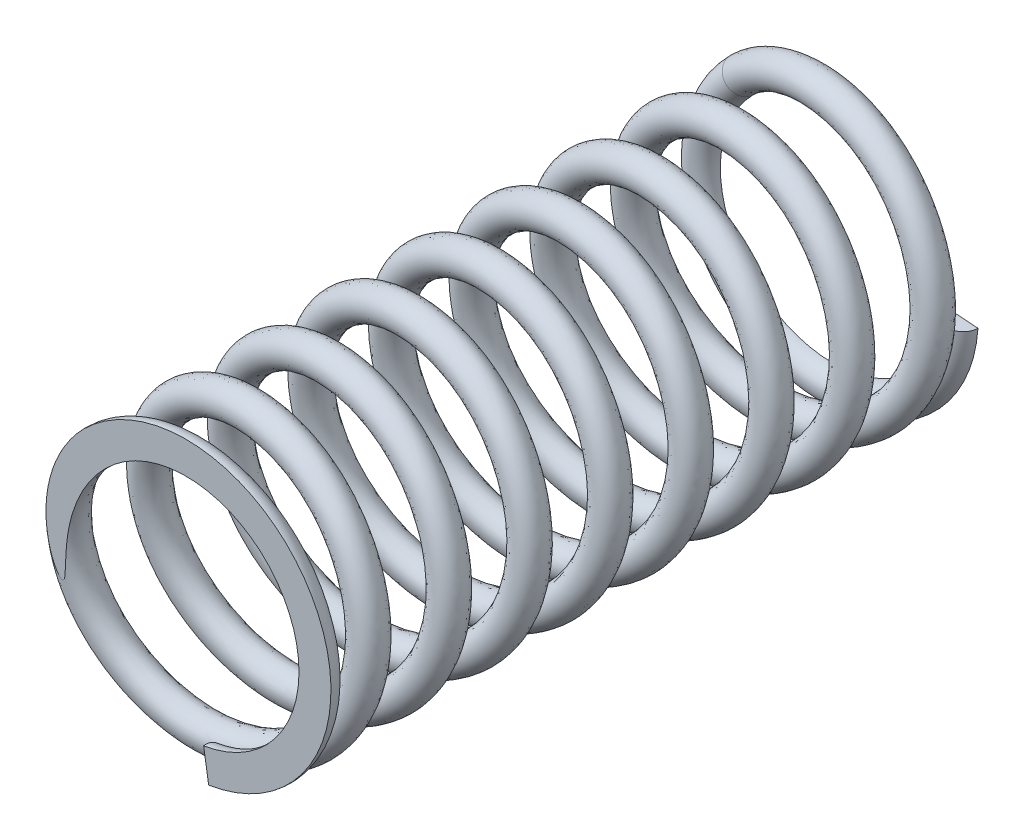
ISO-10303-21;
HEADER;
FILE_DESCRIPTION(('STEP AP214'),'2;1');
FILE_NAME('part.step','',(''),(''),'','','');
FILE_SCHEMA(('AUTOMOTIVE_DESIGN { 1 0 10303 214 1 1 1 1 }'));
ENDSEC;
DATA;
#1=APPLICATION_CONTEXT('core data for automotive mechanical design processes');
#2=APPLICATION_PROTOCOL_DEFINITION('international standard','automotive_design',2000,#1);
#3=PRODUCT_CONTEXT('',#1,'mechanical');
#4=PRODUCT('Part','Part','',(#3));
#5=PRODUCT_RELATED_PRODUCT_CATEGORY('part','',(#4));
#6=PRODUCT_DEFINITION_FORMATION('','',#4);
#7=PRODUCT_DEFINITION_CONTEXT('part definition',#1,'design');
#8=PRODUCT_DEFINITION('design','',#6,#7);
#9=PRODUCT_DEFINITION_SHAPE('','',#8);
#10=(LENGTH_UNIT() NAMED_UNIT(*) SI_UNIT(.MILLI.,.METRE.));
#11=(NAMED_UNIT(*) PLANE_ANGLE_UNIT() SI_UNIT($,.RADIAN.));
#12=(NAMED_UNIT(*) SI_UNIT($,.STERADIAN.) SOLID_ANGLE_UNIT());
#13=UNCERTAINTY_MEASURE_WITH_UNIT(LENGTH_MEASURE(1.E-05),#10,'distance_accuracy_value','');
#14=(GEOMETRIC_REPRESENTATION_CONTEXT(3) GLOBAL_UNCERTAINTY_ASSIGNED_CONTEXT((#13)) GLOBAL_UNIT_ASSIGNED_CONTEXT((#10,
#11,#12)) REPRESENTATION_CONTEXT('',''));
#15=CARTESIAN_POINT('',(0.,0.,0.));
#16=DIRECTION('',(0.,0.,1.));
#17=DIRECTION('',(1.,0.,0.));
#18=AXIS2_PLACEMENT_3D('',#15,#16,#17);
#19=CARTESIAN_POINT('',(-0.494974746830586,0.494974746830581,0.));
#20=CARTESIAN_POINT('',(-0.209200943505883,0.780748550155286,0.0416666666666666));
#21=CARTESIAN_POINT('',(0.181173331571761,0.676148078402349,0.0833333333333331));
#22=CARTESIAN_POINT('',(0.571547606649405,0.571547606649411,0.125));
#23=CARTESIAN_POINT('',(0.676148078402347,0.181173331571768,0.166666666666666));
#24=CARTESIAN_POINT('',(0.780748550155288,-0.209200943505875,0.208333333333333));
#25=CARTESIAN_POINT('',(0.494974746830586,-0.49497474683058,0.249999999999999));
#26=CARTESIAN_POINT('',(0.209200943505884,-0.780748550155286,0.291666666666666));
#27=CARTESIAN_POINT('',(-0.181173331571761,-0.676148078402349,0.333333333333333));
#28=CARTESIAN_POINT('',(-0.571547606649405,-0.571547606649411,0.374999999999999));
#29=CARTESIAN_POINT('',(-0.676148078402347,-0.181173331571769,0.416666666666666));
#30=CARTESIAN_POINT('',(-0.780748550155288,0.209200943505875,0.458333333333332));
#31=CARTESIAN_POINT('',(-0.494974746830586,0.494974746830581,0.499999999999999));
#32=CARTESIAN_POINT('',(-0.209200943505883,0.780748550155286,0.541666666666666));
#33=CARTESIAN_POINT('',(0.181173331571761,0.676148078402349,0.583333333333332));
#34=CARTESIAN_POINT('',(0.571547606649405,0.571547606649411,0.624999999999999));
#35=CARTESIAN_POINT('',(0.676148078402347,0.181173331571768,0.666666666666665));
#36=CARTESIAN_POINT('',(0.780748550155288,-0.209200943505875,0.708333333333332));
#37=CARTESIAN_POINT('',(0.494974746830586,-0.49497474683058,0.749999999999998));
#38=CARTESIAN_POINT('',(0.209200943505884,-0.780748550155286,0.791666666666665));
#39=CARTESIAN_POINT('',(-0.181173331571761,-0.676148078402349,0.833333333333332));
#40=CARTESIAN_POINT('',(-0.571547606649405,-0.571547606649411,0.874999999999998));
#41=CARTESIAN_POINT('',(-0.676148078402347,-0.181173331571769,0.916666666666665));
#42=CARTESIAN_POINT('',(-0.780748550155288,0.209200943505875,0.958333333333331));
#43=CARTESIAN_POINT('',(-0.494974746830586,0.494974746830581,0.999999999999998));
#44=CARTESIAN_POINT('',(-0.209200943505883,0.780748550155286,1.04166666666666));
#45=CARTESIAN_POINT('',(0.181173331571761,0.676148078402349,1.08333333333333));
#46=CARTESIAN_POINT('',(0.571547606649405,0.571547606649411,1.125));
#47=CARTESIAN_POINT('',(0.676148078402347,0.181173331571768,1.16666666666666));
#48=CARTESIAN_POINT('',(0.780748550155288,-0.209200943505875,1.20833333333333));
#49=CARTESIAN_POINT('',(0.494974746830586,-0.49497474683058,1.25));
#50=CARTESIAN_POINT('',(0.209200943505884,-0.780748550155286,1.29166666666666));
#51=CARTESIAN_POINT('',(-0.181173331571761,-0.676148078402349,1.33333333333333));
#52=CARTESIAN_POINT('',(-0.571547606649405,-0.571547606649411,1.375));
#53=CARTESIAN_POINT('',(-0.676148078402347,-0.181173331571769,1.41666666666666));
#54=CARTESIAN_POINT('',(-0.780748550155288,0.209200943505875,1.45833333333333));
#55=CARTESIAN_POINT('',(-0.494974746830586,0.494974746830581,1.5));
#56=CARTESIAN_POINT('',(-0.209200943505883,0.780748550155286,1.54166666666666));
#57=CARTESIAN_POINT('',(0.181173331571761,0.676148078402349,1.58333333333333));
#58=CARTESIAN_POINT('',(0.571547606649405,0.571547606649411,1.625));
#59=CARTESIAN_POINT('',(0.676148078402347,0.181173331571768,1.66666666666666));
#60=CARTESIAN_POINT('',(0.780748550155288,-0.209200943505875,1.70833333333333));
#61=CARTESIAN_POINT('',(0.494974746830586,-0.49497474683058,1.75));
#62=CARTESIAN_POINT('',(0.209200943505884,-0.780748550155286,1.79166666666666));
#63=CARTESIAN_POINT('',(-0.181173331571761,-0.676148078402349,1.83333333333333));
#64=CARTESIAN_POINT('',(-0.571547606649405,-0.571547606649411,1.875));
#65=CARTESIAN_POINT('',(-0.676148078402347,-0.181173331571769,1.91666666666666));
#66=CARTESIAN_POINT('',(-0.780748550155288,0.209200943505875,1.95833333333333));
#67=CARTESIAN_POINT('',(-0.494974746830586,0.494974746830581,2.));
#68=CARTESIAN_POINT('',(-0.209200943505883,0.780748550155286,2.04166666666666));
#69=CARTESIAN_POINT('',(0.181173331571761,0.676148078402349,2.08333333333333));
#70=CARTESIAN_POINT('',(0.571547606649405,0.571547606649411,2.125));
#71=CARTESIAN_POINT('',(0.676148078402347,0.181173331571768,2.16666666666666));
#72=CARTESIAN_POINT('',(0.780748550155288,-0.209200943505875,2.20833333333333));
#73=CARTESIAN_POINT('',(0.494974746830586,-0.49497474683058,2.25));
#74=CARTESIAN_POINT('',(0.209200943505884,-0.780748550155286,2.29166666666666));
#75=CARTESIAN_POINT('',(-0.181173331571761,-0.676148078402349,2.33333333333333));
#76=CARTESIAN_POINT('',(-0.571547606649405,-0.571547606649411,2.37499999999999));
#77=CARTESIAN_POINT('',(-0.676148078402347,-0.181173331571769,2.41666666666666));
#78=CARTESIAN_POINT('',(-0.780748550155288,0.209200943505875,2.45833333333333));
#79=CARTESIAN_POINT('',(-0.494974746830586,0.494974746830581,2.49999999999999));
#80=CARTESIAN_POINT('',(-0.209200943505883,0.780748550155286,2.54166666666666));
#81=CARTESIAN_POINT('',(0.181173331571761,0.676148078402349,2.58333333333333));
#82=CARTESIAN_POINT('',(0.571547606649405,0.571547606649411,2.62499999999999));
#83=CARTESIAN_POINT('',(0.676148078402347,0.181173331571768,2.66666666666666));
#84=CARTESIAN_POINT('',(0.780748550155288,-0.209200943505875,2.70833333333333));
#85=CARTESIAN_POINT('',(0.494974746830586,-0.49497474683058,2.74999999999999));
#86=CARTESIAN_POINT('',(0.209200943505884,-0.780748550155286,2.79166666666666));
#87=CARTESIAN_POINT('',(-0.181173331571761,-0.676148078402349,2.83333333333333));
#88=CARTESIAN_POINT('',(-0.571547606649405,-0.571547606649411,2.87499999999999));
#89=CARTESIAN_POINT('',(-0.676148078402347,-0.181173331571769,2.91666666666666));
#90=CARTESIAN_POINT('',(-0.780748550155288,0.209200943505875,2.95833333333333));
#91=CARTESIAN_POINT('',(-0.494974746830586,0.494974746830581,2.99999999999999));
#92=CARTESIAN_POINT('',(-0.209200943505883,0.780748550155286,3.04166666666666));
#93=CARTESIAN_POINT('',(0.181173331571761,0.676148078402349,3.08333333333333));
#94=CARTESIAN_POINT('',(0.571547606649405,0.571547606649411,3.12499999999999));
#95=CARTESIAN_POINT('',(0.676148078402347,0.181173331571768,3.16666666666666));
#96=CARTESIAN_POINT('',(0.780748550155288,-0.209200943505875,3.20833333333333));
#97=CARTESIAN_POINT('',(0.494974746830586,-0.49497474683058,3.24999999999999));
#98=CARTESIAN_POINT('',(0.209200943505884,-0.780748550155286,3.29166666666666));
#99=CARTESIAN_POINT('',(-0.181173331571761,-0.676148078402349,3.33333333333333));
#100=CARTESIAN_POINT('',(-0.571547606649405,-0.571547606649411,3.37499999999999));
#101=CARTESIAN_POINT('',(-0.676148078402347,-0.181173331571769,3.41666666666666));
#102=CARTESIAN_POINT('',(-0.780748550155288,0.209200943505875,3.45833333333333));
#103=CARTESIAN_POINT('',(-0.494974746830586,0.494974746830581,3.49999999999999));
#104=CARTESIAN_POINT('',(-0.209200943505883,0.780748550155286,3.54166666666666));
#105=CARTESIAN_POINT('',(0.181173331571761,0.676148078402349,3.58333333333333));
#106=CARTESIAN_POINT('',(0.571547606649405,0.571547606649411,3.62499999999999));
#107=CARTESIAN_POINT('',(0.676148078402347,0.181173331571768,3.66666666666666));
#108=CARTESIAN_POINT('',(0.780748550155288,-0.209200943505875,3.70833333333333));
#109=CARTESIAN_POINT('',(0.494974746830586,-0.49497474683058,3.74999999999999));
#110=CARTESIAN_POINT('',(0.209200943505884,-0.780748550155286,3.79166666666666));
#111=CARTESIAN_POINT('',(-0.181173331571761,-0.676148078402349,3.83333333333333));
#112=CARTESIAN_POINT('',(-0.571547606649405,-0.571547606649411,3.87499999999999));
#113=CARTESIAN_POINT('',(-0.676148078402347,-0.181173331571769,3.91666666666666));
#114=CARTESIAN_POINT('',(-0.780748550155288,0.209200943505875,3.95833333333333));
#115=CARTESIAN_POINT('',(-0.494974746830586,0.494974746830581,3.99999999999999));
#116=CARTESIAN_POINT('',(-0.209200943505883,0.780748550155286,4.04166666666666));
#117=CARTESIAN_POINT('',(0.181173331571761,0.676148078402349,4.08333333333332));
#118=CARTESIAN_POINT('',(0.571547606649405,0.571547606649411,4.12499999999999));
#119=CARTESIAN_POINT('',(0.676148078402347,0.181173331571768,4.16666666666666));
#120=CARTESIAN_POINT('',(0.780748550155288,-0.209200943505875,4.20833333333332));
#121=CARTESIAN_POINT('',(0.494974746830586,-0.49497474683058,4.24999999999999));
#122=CARTESIAN_POINT('',(0.209200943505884,-0.780748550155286,4.29166666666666));
#123=CARTESIAN_POINT('',(-0.181173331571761,-0.676148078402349,4.33333333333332));
#124=CARTESIAN_POINT('',(-0.571547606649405,-0.571547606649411,4.37499999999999));
#125=CARTESIAN_POINT('',(-0.676148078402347,-0.181173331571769,4.41666666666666));
#126=CARTESIAN_POINT('',(-0.780748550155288,0.209200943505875,4.45833333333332));
#127=CARTESIAN_POINT('',(-0.494974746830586,0.494974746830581,4.49999999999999));
#128=CARTESIAN_POINT('',(-0.494974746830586,0.494974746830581,0.2));
#129=CARTESIAN_POINT('',(-0.209200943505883,0.780748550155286,0.241666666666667));
#130=CARTESIAN_POINT('',(0.181173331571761,0.676148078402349,0.283333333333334));
#131=CARTESIAN_POINT('',(0.571547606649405,0.571547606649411,0.325));
#132=CARTESIAN_POINT('',(0.676148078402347,0.181173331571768,0.366666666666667));
#133=CARTESIAN_POINT('',(0.780748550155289,-0.209200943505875,0.408333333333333));
#134=CARTESIAN_POINT('',(0.494974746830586,-0.49497474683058,0.45));
#135=CARTESIAN_POINT('',(0.209200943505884,-0.780748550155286,0.491666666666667));
#136=CARTESIAN_POINT('',(-0.181173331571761,-0.676148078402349,0.533333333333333));
#137=CARTESIAN_POINT('',(-0.571547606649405,-0.571547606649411,0.575));
#138=CARTESIAN_POINT('',(-0.676148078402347,-0.181173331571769,0.616666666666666));
#139=CARTESIAN_POINT('',(-0.780748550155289,0.209200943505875,0.658333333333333));
#140=CARTESIAN_POINT('',(-0.494974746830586,0.494974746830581,0.699999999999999));
#141=CARTESIAN_POINT('',(-0.209200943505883,0.780748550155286,0.741666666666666));
#142=CARTESIAN_POINT('',(0.181173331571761,0.676148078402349,0.783333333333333));
#143=CARTESIAN_POINT('',(0.571547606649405,0.571547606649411,0.824999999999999));
#144=CARTESIAN_POINT('',(0.676148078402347,0.181173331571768,0.866666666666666));
#145=CARTESIAN_POINT('',(0.780748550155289,-0.209200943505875,0.908333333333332));
#146=CARTESIAN_POINT('',(0.494974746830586,-0.49497474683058,0.949999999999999));
#147=CARTESIAN_POINT('',(0.209200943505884,-0.780748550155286,0.991666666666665));
#148=CARTESIAN_POINT('',(-0.181173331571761,-0.676148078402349,1.03333333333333));
#149=CARTESIAN_POINT('',(-0.571547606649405,-0.571547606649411,1.075));
#150=CARTESIAN_POINT('',(-0.676148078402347,-0.181173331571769,1.11666666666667));
#151=CARTESIAN_POINT('',(-0.780748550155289,0.209200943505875,1.15833333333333));
#152=CARTESIAN_POINT('',(-0.494974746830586,0.494974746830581,1.2));
#153=CARTESIAN_POINT('',(-0.209200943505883,0.780748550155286,1.24166666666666));
#154=CARTESIAN_POINT('',(0.181173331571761,0.676148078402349,1.28333333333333));
#155=CARTESIAN_POINT('',(0.571547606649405,0.571547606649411,1.325));
#156=CARTESIAN_POINT('',(0.676148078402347,0.181173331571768,1.36666666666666));
#157=CARTESIAN_POINT('',(0.780748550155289,-0.209200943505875,1.40833333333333));
#158=CARTESIAN_POINT('',(0.494974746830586,-0.49497474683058,1.45));
#159=CARTESIAN_POINT('',(0.209200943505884,-0.780748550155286,1.49166666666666));
#160=CARTESIAN_POINT('',(-0.181173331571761,-0.676148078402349,1.53333333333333));
#161=CARTESIAN_POINT('',(-0.571547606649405,-0.571547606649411,1.575));
#162=CARTESIAN_POINT('',(-0.676148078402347,-0.181173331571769,1.61666666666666));
#163=CARTESIAN_POINT('',(-0.780748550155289,0.209200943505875,1.65833333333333));
#164=CARTESIAN_POINT('',(-0.494974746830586,0.494974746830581,1.7));
#165=CARTESIAN_POINT('',(-0.209200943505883,0.780748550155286,1.74166666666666));
#166=CARTESIAN_POINT('',(0.181173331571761,0.676148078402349,1.78333333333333));
#167=CARTESIAN_POINT('',(0.571547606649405,0.571547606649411,1.825));
#168=CARTESIAN_POINT('',(0.676148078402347,0.181173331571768,1.86666666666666));
#169=CARTESIAN_POINT('',(0.780748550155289,-0.209200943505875,1.90833333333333));
#170=CARTESIAN_POINT('',(0.494974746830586,-0.49497474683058,1.95));
#171=CARTESIAN_POINT('',(0.209200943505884,-0.780748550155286,1.99166666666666));
#172=CARTESIAN_POINT('',(-0.181173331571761,-0.676148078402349,2.03333333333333));
#173=CARTESIAN_POINT('',(-0.571547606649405,-0.571547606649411,2.075));
#174=CARTESIAN_POINT('',(-0.676148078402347,-0.181173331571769,2.11666666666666));
#175=CARTESIAN_POINT('',(-0.780748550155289,0.209200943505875,2.15833333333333));
#176=CARTESIAN_POINT('',(-0.494974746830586,0.494974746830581,2.2));
#177=CARTESIAN_POINT('',(-0.209200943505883,0.780748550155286,2.24166666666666));
#178=CARTESIAN_POINT('',(0.181173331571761,0.676148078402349,2.28333333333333));
#179=CARTESIAN_POINT('',(0.571547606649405,0.571547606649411,2.325));
#180=CARTESIAN_POINT('',(0.676148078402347,0.181173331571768,2.36666666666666));
#181=CARTESIAN_POINT('',(0.780748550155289,-0.209200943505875,2.40833333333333));
#182=CARTESIAN_POINT('',(0.494974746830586,-0.49497474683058,2.45));
#183=CARTESIAN_POINT('',(0.209200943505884,-0.780748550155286,2.49166666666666));
#184=CARTESIAN_POINT('',(-0.181173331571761,-0.676148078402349,2.53333333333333));
#185=CARTESIAN_POINT('',(-0.571547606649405,-0.571547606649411,2.575));
#186=CARTESIAN_POINT('',(-0.676148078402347,-0.181173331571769,2.61666666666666));
#187=CARTESIAN_POINT('',(-0.780748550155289,0.209200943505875,2.65833333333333));
#188=CARTESIAN_POINT('',(-0.494974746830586,0.494974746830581,2.69999999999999));
#189=CARTESIAN_POINT('',(-0.209200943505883,0.780748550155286,2.74166666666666));
#190=CARTESIAN_POINT('',(0.181173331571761,0.676148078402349,2.78333333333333));
#191=CARTESIAN_POINT('',(0.571547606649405,0.571547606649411,2.825));
#192=CARTESIAN_POINT('',(0.676148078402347,0.181173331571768,2.86666666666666));
#193=CARTESIAN_POINT('',(0.780748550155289,-0.209200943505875,2.90833333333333));
#194=CARTESIAN_POINT('',(0.494974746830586,-0.49497474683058,2.94999999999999));
#195=CARTESIAN_POINT('',(0.209200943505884,-0.780748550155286,2.99166666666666));
#196=CARTESIAN_POINT('',(-0.181173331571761,-0.676148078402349,3.03333333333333));
#197=CARTESIAN_POINT('',(-0.571547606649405,-0.571547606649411,3.07499999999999));
#198=CARTESIAN_POINT('',(-0.676148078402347,-0.181173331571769,3.11666666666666));
#199=CARTESIAN_POINT('',(-0.780748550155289,0.209200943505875,3.15833333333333));
#200=CARTESIAN_POINT('',(-0.494974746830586,0.494974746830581,3.19999999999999));
#201=CARTESIAN_POINT('',(-0.209200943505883,0.780748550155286,3.24166666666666));
#202=CARTESIAN_POINT('',(0.181173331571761,0.676148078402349,3.28333333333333));
#203=CARTESIAN_POINT('',(0.571547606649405,0.571547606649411,3.32499999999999));
#204=CARTESIAN_POINT('',(0.676148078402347,0.181173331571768,3.36666666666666));
#205=CARTESIAN_POINT('',(0.780748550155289,-0.209200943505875,3.40833333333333));
#206=CARTESIAN_POINT('',(0.494974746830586,-0.49497474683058,3.44999999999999));
#207=CARTESIAN_POINT('',(0.209200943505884,-0.780748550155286,3.49166666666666));
#208=CARTESIAN_POINT('',(-0.181173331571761,-0.676148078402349,3.53333333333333));
#209=CARTESIAN_POINT('',(-0.571547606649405,-0.571547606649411,3.57499999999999));
#210=CARTESIAN_POINT('',(-0.676148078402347,-0.181173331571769,3.61666666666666));
#211=CARTESIAN_POINT('',(-0.780748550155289,0.209200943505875,3.65833333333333));
#212=CARTESIAN_POINT('',(-0.494974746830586,0.494974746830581,3.69999999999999));
#213=CARTESIAN_POINT('',(-0.209200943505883,0.780748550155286,3.74166666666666));
#214=CARTESIAN_POINT('',(0.181173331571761,0.676148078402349,3.78333333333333));
#215=CARTESIAN_POINT('',(0.571547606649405,0.571547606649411,3.82499999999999));
#216=CARTESIAN_POINT('',(0.676148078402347,0.181173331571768,3.86666666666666));
#217=CARTESIAN_POINT('',(0.780748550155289,-0.209200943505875,3.90833333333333));
#218=CARTESIAN_POINT('',(0.494974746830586,-0.49497474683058,3.94999999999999));
#219=CARTESIAN_POINT('',(0.209200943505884,-0.780748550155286,3.99166666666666));
#220=CARTESIAN_POINT('',(-0.181173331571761,-0.676148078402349,4.03333333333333));
#221=CARTESIAN_POINT('',(-0.571547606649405,-0.571547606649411,4.07499999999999));
#222=CARTESIAN_POINT('',(-0.676148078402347,-0.181173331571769,4.11666666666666));
#223=CARTESIAN_POINT('',(-0.780748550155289,0.209200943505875,4.15833333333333));
#224=CARTESIAN_POINT('',(-0.494974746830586,0.494974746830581,4.19999999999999));
#225=CARTESIAN_POINT('',(-0.209200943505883,0.780748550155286,4.24166666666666));
#226=CARTESIAN_POINT('',(0.181173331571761,0.676148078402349,4.28333333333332));
#227=CARTESIAN_POINT('',(0.571547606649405,0.571547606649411,4.32499999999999));
#228=CARTESIAN_POINT('',(0.676148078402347,0.181173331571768,4.36666666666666));
#229=CARTESIAN_POINT('',(0.780748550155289,-0.209200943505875,4.40833333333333));
#230=CARTESIAN_POINT('',(0.494974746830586,-0.49497474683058,4.44999999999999));
#231=CARTESIAN_POINT('',(0.209200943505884,-0.780748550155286,4.49166666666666));
#232=CARTESIAN_POINT('',(-0.181173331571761,-0.676148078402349,4.53333333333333));
#233=CARTESIAN_POINT('',(-0.571547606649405,-0.571547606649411,4.57499999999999));
#234=CARTESIAN_POINT('',(-0.676148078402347,-0.181173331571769,4.61666666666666));
#235=CARTESIAN_POINT('',(-0.780748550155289,0.209200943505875,4.65833333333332));
#236=CARTESIAN_POINT('',(-0.494974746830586,0.494974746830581,4.69999999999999));
#237=CARTESIAN_POINT('',(-0.636396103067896,0.63639610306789,0.2));
#238=CARTESIAN_POINT('',(-0.268972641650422,1.00381956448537,0.241666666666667));
#239=CARTESIAN_POINT('',(0.232937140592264,0.869333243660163,0.283333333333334));
#240=CARTESIAN_POINT('',(0.73484692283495,0.734846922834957,0.325));
#241=CARTESIAN_POINT('',(0.86933324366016,0.232937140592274,0.366666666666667));
#242=CARTESIAN_POINT('',(1.00381956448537,-0.268972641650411,0.408333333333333));
#243=CARTESIAN_POINT('',(0.636396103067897,-0.636396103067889,0.45));
#244=CARTESIAN_POINT('',(0.268972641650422,-1.00381956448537,0.491666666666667));
#245=CARTESIAN_POINT('',(-0.232937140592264,-0.869333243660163,0.533333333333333));
#246=CARTESIAN_POINT('',(-0.73484692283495,-0.734846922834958,0.575));
#247=CARTESIAN_POINT('',(-0.86933324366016,-0.232937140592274,0.616666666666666));
#248=CARTESIAN_POINT('',(-1.00381956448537,0.26897264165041,0.658333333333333));
#249=CARTESIAN_POINT('',(-0.636396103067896,0.63639610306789,0.699999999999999));
#250=CARTESIAN_POINT('',(-0.268972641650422,1.00381956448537,0.741666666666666));
#251=CARTESIAN_POINT('',(0.232937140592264,0.869333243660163,0.783333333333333));
#252=CARTESIAN_POINT('',(0.73484692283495,0.734846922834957,0.824999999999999));
#253=CARTESIAN_POINT('',(0.86933324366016,0.232937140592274,0.866666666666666));
#254=CARTESIAN_POINT('',(1.00381956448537,-0.268972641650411,0.908333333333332));
#255=CARTESIAN_POINT('',(0.636396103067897,-0.636396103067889,0.949999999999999));
#256=CARTESIAN_POINT('',(0.268972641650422,-1.00381956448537,0.991666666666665));
#257=CARTESIAN_POINT('',(-0.232937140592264,-0.869333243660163,1.03333333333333));
#258=CARTESIAN_POINT('',(-0.73484692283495,-0.734846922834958,1.075));
#259=CARTESIAN_POINT('',(-0.86933324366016,-0.232937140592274,1.11666666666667));
#260=CARTESIAN_POINT('',(-1.00381956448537,0.26897264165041,1.15833333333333));
#261=CARTESIAN_POINT('',(-0.636396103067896,0.63639610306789,1.2));
#262=CARTESIAN_POINT('',(-0.268972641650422,1.00381956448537,1.24166666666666));
#263=CARTESIAN_POINT('',(0.232937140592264,0.869333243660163,1.28333333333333));
#264=CARTESIAN_POINT('',(0.73484692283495,0.734846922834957,1.325));
#265=CARTESIAN_POINT('',(0.86933324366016,0.232937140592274,1.36666666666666));
#266=CARTESIAN_POINT('',(1.00381956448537,-0.268972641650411,1.40833333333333));
#267=CARTESIAN_POINT('',(0.636396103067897,-0.636396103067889,1.45));
#268=CARTESIAN_POINT('',(0.268972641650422,-1.00381956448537,1.49166666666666));
#269=CARTESIAN_POINT('',(-0.232937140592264,-0.869333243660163,1.53333333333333));
#270=CARTESIAN_POINT('',(-0.73484692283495,-0.734846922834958,1.575));
#271=CARTESIAN_POINT('',(-0.86933324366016,-0.232937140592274,1.61666666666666));
#272=CARTESIAN_POINT('',(-1.00381956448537,0.26897264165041,1.65833333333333));
#273=CARTESIAN_POINT('',(-0.636396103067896,0.63639610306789,1.7));
#274=CARTESIAN_POINT('',(-0.268972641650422,1.00381956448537,1.74166666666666));
#275=CARTESIAN_POINT('',(0.232937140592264,0.869333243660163,1.78333333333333));
#276=CARTESIAN_POINT('',(0.73484692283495,0.734846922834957,1.825));
#277=CARTESIAN_POINT('',(0.86933324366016,0.232937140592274,1.86666666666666));
#278=CARTESIAN_POINT('',(1.00381956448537,-0.268972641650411,1.90833333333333));
#279=CARTESIAN_POINT('',(0.636396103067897,-0.636396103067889,1.95));
#280=CARTESIAN_POINT('',(0.268972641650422,-1.00381956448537,1.99166666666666));
#281=CARTESIAN_POINT('',(-0.232937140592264,-0.869333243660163,2.03333333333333));
#282=CARTESIAN_POINT('',(-0.73484692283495,-0.734846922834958,2.075));
#283=CARTESIAN_POINT('',(-0.86933324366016,-0.232937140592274,2.11666666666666));
#284=CARTESIAN_POINT('',(-1.00381956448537,0.26897264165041,2.15833333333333));
#285=CARTESIAN_POINT('',(-0.636396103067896,0.63639610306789,2.2));
#286=CARTESIAN_POINT('',(-0.268972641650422,1.00381956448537,2.24166666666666));
#287=CARTESIAN_POINT('',(0.232937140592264,0.869333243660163,2.28333333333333));
#288=CARTESIAN_POINT('',(0.73484692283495,0.734846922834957,2.325));
#289=CARTESIAN_POINT('',(0.86933324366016,0.232937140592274,2.36666666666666));
#290=CARTESIAN_POINT('',(1.00381956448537,-0.268972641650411,2.40833333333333));
#291=CARTESIAN_POINT('',(0.636396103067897,-0.636396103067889,2.45));
#292=CARTESIAN_POINT('',(0.268972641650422,-1.00381956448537,2.49166666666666));
#293=CARTESIAN_POINT('',(-0.232937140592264,-0.869333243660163,2.53333333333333));
#294=CARTESIAN_POINT('',(-0.73484692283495,-0.734846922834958,2.575));
#295=CARTESIAN_POINT('',(-0.86933324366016,-0.232937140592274,2.61666666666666));
#296=CARTESIAN_POINT('',(-1.00381956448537,0.26897264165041,2.65833333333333));
#297=CARTESIAN_POINT('',(-0.636396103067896,0.63639610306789,2.69999999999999));
#298=CARTESIAN_POINT('',(-0.268972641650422,1.00381956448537,2.74166666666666));
#299=CARTESIAN_POINT('',(0.232937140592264,0.869333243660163,2.78333333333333));
#300=CARTESIAN_POINT('',(0.73484692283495,0.734846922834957,2.825));
#301=CARTESIAN_POINT('',(0.86933324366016,0.232937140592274,2.86666666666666));
#302=CARTESIAN_POINT('',(1.00381956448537,-0.268972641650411,2.90833333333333));
#303=CARTESIAN_POINT('',(0.636396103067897,-0.636396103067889,2.94999999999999));
#304=CARTESIAN_POINT('',(0.268972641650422,-1.00381956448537,2.99166666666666));
#305=CARTESIAN_POINT('',(-0.232937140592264,-0.869333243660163,3.03333333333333));
#306=CARTESIAN_POINT('',(-0.73484692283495,-0.734846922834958,3.07499999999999));
#307=CARTESIAN_POINT('',(-0.86933324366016,-0.232937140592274,3.11666666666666));
#308=CARTESIAN_POINT('',(-1.00381956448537,0.26897264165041,3.15833333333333));
#309=CARTESIAN_POINT('',(-0.636396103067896,0.63639610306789,3.19999999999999));
#310=CARTESIAN_POINT('',(-0.268972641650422,1.00381956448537,3.24166666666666));
#311=CARTESIAN_POINT('',(0.232937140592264,0.869333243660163,3.28333333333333));
#312=CARTESIAN_POINT('',(0.73484692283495,0.734846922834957,3.32499999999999));
#313=CARTESIAN_POINT('',(0.86933324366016,0.232937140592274,3.36666666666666));
#314=CARTESIAN_POINT('',(1.00381956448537,-0.268972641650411,3.40833333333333));
#315=CARTESIAN_POINT('',(0.636396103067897,-0.636396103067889,3.44999999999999));
#316=CARTESIAN_POINT('',(0.268972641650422,-1.00381956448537,3.49166666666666));
#317=CARTESIAN_POINT('',(-0.232937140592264,-0.869333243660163,3.53333333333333));
#318=CARTESIAN_POINT('',(-0.73484692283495,-0.734846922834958,3.57499999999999));
#319=CARTESIAN_POINT('',(-0.86933324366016,-0.232937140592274,3.61666666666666));
#320=CARTESIAN_POINT('',(-1.00381956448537,0.26897264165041,3.65833333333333));
#321=CARTESIAN_POINT('',(-0.636396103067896,0.63639610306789,3.69999999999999));
#322=CARTESIAN_POINT('',(-0.268972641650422,1.00381956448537,3.74166666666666));
#323=CARTESIAN_POINT('',(0.232937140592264,0.869333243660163,3.78333333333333));
#324=CARTESIAN_POINT('',(0.73484692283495,0.734846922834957,3.82499999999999));
#325=CARTESIAN_POINT('',(0.86933324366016,0.232937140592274,3.86666666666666));
#326=CARTESIAN_POINT('',(1.00381956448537,-0.268972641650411,3.90833333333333));
#327=CARTESIAN_POINT('',(0.636396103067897,-0.636396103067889,3.94999999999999));
#328=CARTESIAN_POINT('',(0.268972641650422,-1.00381956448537,3.99166666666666));
#329=CARTESIAN_POINT('',(-0.232937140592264,-0.869333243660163,4.03333333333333));
#330=CARTESIAN_POINT('',(-0.73484692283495,-0.734846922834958,4.07499999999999));
#331=CARTESIAN_POINT('',(-0.86933324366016,-0.232937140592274,4.11666666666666));
#332=CARTESIAN_POINT('',(-1.00381956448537,0.26897264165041,4.15833333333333));
#333=CARTESIAN_POINT('',(-0.636396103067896,0.63639610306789,4.19999999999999));
#334=CARTESIAN_POINT('',(-0.268972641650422,1.00381956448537,4.24166666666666));
#335=CARTESIAN_POINT('',(0.232937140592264,0.869333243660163,4.28333333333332));
#336=CARTESIAN_POINT('',(0.73484692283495,0.734846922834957,4.32499999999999));
#337=CARTESIAN_POINT('',(0.86933324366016,0.232937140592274,4.36666666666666));
#338=CARTESIAN_POINT('',(1.00381956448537,-0.268972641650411,4.40833333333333));
#339=CARTESIAN_POINT('',(0.636396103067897,-0.636396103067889,4.44999999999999));
#340=CARTESIAN_POINT('',(0.268972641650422,-1.00381956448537,4.49166666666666));
#341=CARTESIAN_POINT('',(-0.232937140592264,-0.869333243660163,4.53333333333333));
#342=CARTESIAN_POINT('',(-0.73484692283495,-0.734846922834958,4.57499999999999));
#343=CARTESIAN_POINT('',(-0.86933324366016,-0.232937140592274,4.61666666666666));
#344=CARTESIAN_POINT('',(-1.00381956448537,0.26897264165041,4.65833333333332));
#345=CARTESIAN_POINT('',(-0.636396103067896,0.63639610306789,4.69999999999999));
#346=CARTESIAN_POINT('',(-0.636396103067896,0.63639610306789,0.));
#347=CARTESIAN_POINT('',(-0.268972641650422,1.00381956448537,0.0416666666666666));
#348=CARTESIAN_POINT('',(0.232937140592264,0.869333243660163,0.0833333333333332));
#349=CARTESIAN_POINT('',(0.73484692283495,0.734846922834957,0.125));
#350=CARTESIAN_POINT('',(0.86933324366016,0.232937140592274,0.166666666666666));
#351=CARTESIAN_POINT('',(1.00381956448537,-0.268972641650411,0.208333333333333));
#352=CARTESIAN_POINT('',(0.636396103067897,-0.63639610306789,0.249999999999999));
#353=CARTESIAN_POINT('',(0.268972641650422,-1.00381956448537,0.291666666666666));
#354=CARTESIAN_POINT('',(-0.232937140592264,-0.869333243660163,0.333333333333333));
#355=CARTESIAN_POINT('',(-0.73484692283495,-0.734846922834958,0.374999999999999));
#356=CARTESIAN_POINT('',(-0.86933324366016,-0.232937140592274,0.416666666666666));
#357=CARTESIAN_POINT('',(-1.00381956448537,0.26897264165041,0.458333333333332));
#358=CARTESIAN_POINT('',(-0.636396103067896,0.63639610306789,0.499999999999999));
#359=CARTESIAN_POINT('',(-0.268972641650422,1.00381956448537,0.541666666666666));
#360=CARTESIAN_POINT('',(0.232937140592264,0.869333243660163,0.583333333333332));
#361=CARTESIAN_POINT('',(0.73484692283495,0.734846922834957,0.624999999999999));
#362=CARTESIAN_POINT('',(0.86933324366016,0.232937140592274,0.666666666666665));
#363=CARTESIAN_POINT('',(1.00381956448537,-0.268972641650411,0.708333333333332));
#364=CARTESIAN_POINT('',(0.636396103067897,-0.63639610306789,0.749999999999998));
#365=CARTESIAN_POINT('',(0.268972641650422,-1.00381956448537,0.791666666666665));
#366=CARTESIAN_POINT('',(-0.232937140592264,-0.869333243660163,0.833333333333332));
#367=CARTESIAN_POINT('',(-0.73484692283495,-0.734846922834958,0.874999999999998));
#368=CARTESIAN_POINT('',(-0.86933324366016,-0.232937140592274,0.916666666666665));
#369=CARTESIAN_POINT('',(-1.00381956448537,0.26897264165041,0.958333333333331));
#370=CARTESIAN_POINT('',(-0.636396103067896,0.63639610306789,0.999999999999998));
#371=CARTESIAN_POINT('',(-0.268972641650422,1.00381956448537,1.04166666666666));
#372=CARTESIAN_POINT('',(0.232937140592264,0.869333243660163,1.08333333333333));
#373=CARTESIAN_POINT('',(0.73484692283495,0.734846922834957,1.125));
#374=CARTESIAN_POINT('',(0.86933324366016,0.232937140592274,1.16666666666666));
#375=CARTESIAN_POINT('',(1.00381956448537,-0.268972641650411,1.20833333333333));
#376=CARTESIAN_POINT('',(0.636396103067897,-0.63639610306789,1.25));
#377=CARTESIAN_POINT('',(0.268972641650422,-1.00381956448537,1.29166666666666));
#378=CARTESIAN_POINT('',(-0.232937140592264,-0.869333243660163,1.33333333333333));
#379=CARTESIAN_POINT('',(-0.73484692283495,-0.734846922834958,1.375));
#380=CARTESIAN_POINT('',(-0.86933324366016,-0.232937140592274,1.41666666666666));
#381=CARTESIAN_POINT('',(-1.00381956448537,0.26897264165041,1.45833333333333));
#382=CARTESIAN_POINT('',(-0.636396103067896,0.63639610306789,1.5));
#383=CARTESIAN_POINT('',(-0.268972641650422,1.00381956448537,1.54166666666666));
#384=CARTESIAN_POINT('',(0.232937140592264,0.869333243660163,1.58333333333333));
#385=CARTESIAN_POINT('',(0.73484692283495,0.734846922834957,1.625));
#386=CARTESIAN_POINT('',(0.86933324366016,0.232937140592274,1.66666666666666));
#387=CARTESIAN_POINT('',(1.00381956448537,-0.268972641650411,1.70833333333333));
#388=CARTESIAN_POINT('',(0.636396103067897,-0.63639610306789,1.75));
#389=CARTESIAN_POINT('',(0.268972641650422,-1.00381956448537,1.79166666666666));
#390=CARTESIAN_POINT('',(-0.232937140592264,-0.869333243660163,1.83333333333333));
#391=CARTESIAN_POINT('',(-0.73484692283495,-0.734846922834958,1.875));
#392=CARTESIAN_POINT('',(-0.86933324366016,-0.232937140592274,1.91666666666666));
#393=CARTESIAN_POINT('',(-1.00381956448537,0.26897264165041,1.95833333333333));
#394=CARTESIAN_POINT('',(-0.636396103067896,0.63639610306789,2.));
#395=CARTESIAN_POINT('',(-0.268972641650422,1.00381956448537,2.04166666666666));
#396=CARTESIAN_POINT('',(0.232937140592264,0.869333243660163,2.08333333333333));
#397=CARTESIAN_POINT('',(0.73484692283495,0.734846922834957,2.125));
#398=CARTESIAN_POINT('',(0.86933324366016,0.232937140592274,2.16666666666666));
#399=CARTESIAN_POINT('',(1.00381956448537,-0.268972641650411,2.20833333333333));
#400=CARTESIAN_POINT('',(0.636396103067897,-0.63639610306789,2.25));
#401=CARTESIAN_POINT('',(0.268972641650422,-1.00381956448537,2.29166666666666));
#402=CARTESIAN_POINT('',(-0.232937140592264,-0.869333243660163,2.33333333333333));
#403=CARTESIAN_POINT('',(-0.73484692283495,-0.734846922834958,2.37499999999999));
#404=CARTESIAN_POINT('',(-0.86933324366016,-0.232937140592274,2.41666666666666));
#405=CARTESIAN_POINT('',(-1.00381956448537,0.26897264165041,2.45833333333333));
#406=CARTESIAN_POINT('',(-0.636396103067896,0.63639610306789,2.49999999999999));
#407=CARTESIAN_POINT('',(-0.268972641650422,1.00381956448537,2.54166666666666));
#408=CARTESIAN_POINT('',(0.232937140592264,0.869333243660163,2.58333333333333));
#409=CARTESIAN_POINT('',(0.73484692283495,0.734846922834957,2.62499999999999));
#410=CARTESIAN_POINT('',(0.86933324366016,0.232937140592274,2.66666666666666));
#411=CARTESIAN_POINT('',(1.00381956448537,-0.268972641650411,2.70833333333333));
#412=CARTESIAN_POINT('',(0.636396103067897,-0.63639610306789,2.74999999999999));
#413=CARTESIAN_POINT('',(0.268972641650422,-1.00381956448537,2.79166666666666));
#414=CARTESIAN_POINT('',(-0.232937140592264,-0.869333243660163,2.83333333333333));
#415=CARTESIAN_POINT('',(-0.73484692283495,-0.734846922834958,2.87499999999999));
#416=CARTESIAN_POINT('',(-0.86933324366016,-0.232937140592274,2.91666666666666));
#417=CARTESIAN_POINT('',(-1.00381956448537,0.26897264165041,2.95833333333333));
#418=CARTESIAN_POINT('',(-0.636396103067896,0.63639610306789,2.99999999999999));
#419=CARTESIAN_POINT('',(-0.268972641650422,1.00381956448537,3.04166666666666));
#420=CARTESIAN_POINT('',(0.232937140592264,0.869333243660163,3.08333333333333));
#421=CARTESIAN_POINT('',(0.73484692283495,0.734846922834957,3.12499999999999));
#422=CARTESIAN_POINT('',(0.86933324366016,0.232937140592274,3.16666666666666));
#423=CARTESIAN_POINT('',(1.00381956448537,-0.268972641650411,3.20833333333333));
#424=CARTESIAN_POINT('',(0.636396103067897,-0.63639610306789,3.24999999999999));
#425=CARTESIAN_POINT('',(0.268972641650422,-1.00381956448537,3.29166666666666));
#426=CARTESIAN_POINT('',(-0.232937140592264,-0.869333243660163,3.33333333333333));
#427=CARTESIAN_POINT('',(-0.73484692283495,-0.734846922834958,3.37499999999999));
#428=CARTESIAN_POINT('',(-0.86933324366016,-0.232937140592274,3.41666666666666));
#429=CARTESIAN_POINT('',(-1.00381956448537,0.26897264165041,3.45833333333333));
#430=CARTESIAN_POINT('',(-0.636396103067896,0.63639610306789,3.49999999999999));
#431=CARTESIAN_POINT('',(-0.268972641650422,1.00381956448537,3.54166666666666));
#432=CARTESIAN_POINT('',(0.232937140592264,0.869333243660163,3.58333333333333));
#433=CARTESIAN_POINT('',(0.73484692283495,0.734846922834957,3.62499999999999));
#434=CARTESIAN_POINT('',(0.86933324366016,0.232937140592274,3.66666666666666));
#435=CARTESIAN_POINT('',(1.00381956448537,-0.268972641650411,3.70833333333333));
#436=CARTESIAN_POINT('',(0.636396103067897,-0.63639610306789,3.74999999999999));
#437=CARTESIAN_POINT('',(0.268972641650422,-1.00381956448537,3.79166666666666));
#438=CARTESIAN_POINT('',(-0.232937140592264,-0.869333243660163,3.83333333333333));
#439=CARTESIAN_POINT('',(-0.73484692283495,-0.734846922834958,3.87499999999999));
#440=CARTESIAN_POINT('',(-0.86933324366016,-0.232937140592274,3.91666666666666));
#441=CARTESIAN_POINT('',(-1.00381956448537,0.26897264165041,3.95833333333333));
#442=CARTESIAN_POINT('',(-0.636396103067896,0.63639610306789,3.99999999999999));
#443=CARTESIAN_POINT('',(-0.268972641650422,1.00381956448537,4.04166666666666));
#444=CARTESIAN_POINT('',(0.232937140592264,0.869333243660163,4.08333333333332));
#445=CARTESIAN_POINT('',(0.73484692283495,0.734846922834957,4.12499999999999));
#446=CARTESIAN_POINT('',(0.86933324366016,0.232937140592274,4.16666666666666));
#447=CARTESIAN_POINT('',(1.00381956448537,-0.268972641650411,4.20833333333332));
#448=CARTESIAN_POINT('',(0.636396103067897,-0.63639610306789,4.24999999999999));
#449=CARTESIAN_POINT('',(0.268972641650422,-1.00381956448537,4.29166666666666));
#450=CARTESIAN_POINT('',(-0.232937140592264,-0.869333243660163,4.33333333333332));
#451=CARTESIAN_POINT('',(-0.73484692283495,-0.734846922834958,4.37499999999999));
#452=CARTESIAN_POINT('',(-0.86933324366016,-0.232937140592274,4.41666666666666));
#453=CARTESIAN_POINT('',(-1.00381956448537,0.26897264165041,4.45833333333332));
#454=CARTESIAN_POINT('',(-0.636396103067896,0.63639610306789,4.49999999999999));
#455=CARTESIAN_POINT('',(-0.636396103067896,0.63639610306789,-0.2));
#456=CARTESIAN_POINT('',(-0.268972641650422,1.00381956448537,-0.158333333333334));
#457=CARTESIAN_POINT('',(0.232937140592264,0.869333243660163,-0.116666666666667));
#458=CARTESIAN_POINT('',(0.73484692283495,0.734846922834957,-0.0750000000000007));
#459=CARTESIAN_POINT('',(0.86933324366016,0.232937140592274,-0.0333333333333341));
#460=CARTESIAN_POINT('',(1.00381956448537,-0.268972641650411,0.00833333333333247));
#461=CARTESIAN_POINT('',(0.636396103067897,-0.636396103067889,0.049999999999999));
#462=CARTESIAN_POINT('',(0.268972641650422,-1.00381956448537,0.0916666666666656));
#463=CARTESIAN_POINT('',(-0.232937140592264,-0.869333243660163,0.133333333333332));
#464=CARTESIAN_POINT('',(-0.73484692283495,-0.734846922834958,0.174999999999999));
#465=CARTESIAN_POINT('',(-0.86933324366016,-0.232937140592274,0.216666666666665));
#466=CARTESIAN_POINT('',(-1.00381956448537,0.26897264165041,0.258333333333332));
#467=CARTESIAN_POINT('',(-0.636396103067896,0.63639610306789,0.299999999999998));
#468=CARTESIAN_POINT('',(-0.268972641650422,1.00381956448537,0.341666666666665));
#469=CARTESIAN_POINT('',(0.232937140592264,0.869333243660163,0.383333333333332));
#470=CARTESIAN_POINT('',(0.73484692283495,0.734846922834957,0.424999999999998));
#471=CARTESIAN_POINT('',(0.86933324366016,0.232937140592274,0.466666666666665));
#472=CARTESIAN_POINT('',(1.00381956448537,-0.268972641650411,0.508333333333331));
#473=CARTESIAN_POINT('',(0.636396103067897,-0.636396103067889,0.549999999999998));
#474=CARTESIAN_POINT('',(0.268972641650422,-1.00381956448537,0.591666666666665));
#475=CARTESIAN_POINT('',(-0.232937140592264,-0.869333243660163,0.633333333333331));
#476=CARTESIAN_POINT('',(-0.73484692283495,-0.734846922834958,0.674999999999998));
#477=CARTESIAN_POINT('',(-0.86933324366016,-0.232937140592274,0.716666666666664));
#478=CARTESIAN_POINT('',(-1.00381956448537,0.26897264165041,0.758333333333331));
#479=CARTESIAN_POINT('',(-0.636396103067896,0.63639610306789,0.799999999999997));
#480=CARTESIAN_POINT('',(-0.268972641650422,1.00381956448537,0.841666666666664));
#481=CARTESIAN_POINT('',(0.232937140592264,0.869333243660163,0.883333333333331));
#482=CARTESIAN_POINT('',(0.73484692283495,0.734846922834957,0.924999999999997));
#483=CARTESIAN_POINT('',(0.86933324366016,0.232937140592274,0.966666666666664));
#484=CARTESIAN_POINT('',(1.00381956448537,-0.268972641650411,1.00833333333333));
#485=CARTESIAN_POINT('',(0.636396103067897,-0.636396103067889,1.05));
#486=CARTESIAN_POINT('',(0.268972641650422,-1.00381956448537,1.09166666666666));
#487=CARTESIAN_POINT('',(-0.232937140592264,-0.869333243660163,1.13333333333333));
#488=CARTESIAN_POINT('',(-0.73484692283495,-0.734846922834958,1.175));
#489=CARTESIAN_POINT('',(-0.86933324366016,-0.232937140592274,1.21666666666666));
#490=CARTESIAN_POINT('',(-1.00381956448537,0.26897264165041,1.25833333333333));
#491=CARTESIAN_POINT('',(-0.636396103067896,0.63639610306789,1.3));
#492=CARTESIAN_POINT('',(-0.268972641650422,1.00381956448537,1.34166666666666));
#493=CARTESIAN_POINT('',(0.232937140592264,0.869333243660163,1.38333333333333));
#494=CARTESIAN_POINT('',(0.73484692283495,0.734846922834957,1.425));
#495=CARTESIAN_POINT('',(0.86933324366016,0.232937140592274,1.46666666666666));
#496=CARTESIAN_POINT('',(1.00381956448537,-0.268972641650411,1.50833333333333));
#497=CARTESIAN_POINT('',(0.636396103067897,-0.636396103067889,1.55));
#498=CARTESIAN_POINT('',(0.268972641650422,-1.00381956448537,1.59166666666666));
#499=CARTESIAN_POINT('',(-0.232937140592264,-0.869333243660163,1.63333333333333));
#500=CARTESIAN_POINT('',(-0.73484692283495,-0.734846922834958,1.675));
#501=CARTESIAN_POINT('',(-0.86933324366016,-0.232937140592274,1.71666666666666));
#502=CARTESIAN_POINT('',(-1.00381956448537,0.26897264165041,1.75833333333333));
#503=CARTESIAN_POINT('',(-0.636396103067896,0.63639610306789,1.79999999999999));
#504=CARTESIAN_POINT('',(-0.268972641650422,1.00381956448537,1.84166666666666));
#505=CARTESIAN_POINT('',(0.232937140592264,0.869333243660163,1.88333333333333));
#506=CARTESIAN_POINT('',(0.73484692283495,0.734846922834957,1.925));
#507=CARTESIAN_POINT('',(0.86933324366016,0.232937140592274,1.96666666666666));
#508=CARTESIAN_POINT('',(1.00381956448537,-0.268972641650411,2.00833333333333));
#509=CARTESIAN_POINT('',(0.636396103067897,-0.636396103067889,2.04999999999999));
#510=CARTESIAN_POINT('',(0.268972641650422,-1.00381956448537,2.09166666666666));
#511=CARTESIAN_POINT('',(-0.232937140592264,-0.869333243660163,2.13333333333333));
#512=CARTESIAN_POINT('',(-0.73484692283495,-0.734846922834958,2.17499999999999));
#513=CARTESIAN_POINT('',(-0.86933324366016,-0.232937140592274,2.21666666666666));
#514=CARTESIAN_POINT('',(-1.00381956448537,0.26897264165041,2.25833333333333));
#515=CARTESIAN_POINT('',(-0.636396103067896,0.63639610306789,2.29999999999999));
#516=CARTESIAN_POINT('',(-0.268972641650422,1.00381956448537,2.34166666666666));
#517=CARTESIAN_POINT('',(0.232937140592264,0.869333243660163,2.38333333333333));
#518=CARTESIAN_POINT('',(0.73484692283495,0.734846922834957,2.42499999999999));
#519=CARTESIAN_POINT('',(0.86933324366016,0.232937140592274,2.46666666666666));
#520=CARTESIAN_POINT('',(1.00381956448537,-0.268972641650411,2.50833333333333));
#521=CARTESIAN_POINT('',(0.636396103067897,-0.636396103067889,2.54999999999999));
#522=CARTESIAN_POINT('',(0.268972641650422,-1.00381956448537,2.59166666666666));
#523=CARTESIAN_POINT('',(-0.232937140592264,-0.869333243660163,2.63333333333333));
#524=CARTESIAN_POINT('',(-0.73484692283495,-0.734846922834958,2.67499999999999));
#525=CARTESIAN_POINT('',(-0.86933324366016,-0.232937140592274,2.71666666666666));
#526=CARTESIAN_POINT('',(-1.00381956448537,0.26897264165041,2.75833333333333));
#527=CARTESIAN_POINT('',(-0.636396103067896,0.63639610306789,2.79999999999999));
#528=CARTESIAN_POINT('',(-0.268972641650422,1.00381956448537,2.84166666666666));
#529=CARTESIAN_POINT('',(0.232937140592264,0.869333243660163,2.88333333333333));
#530=CARTESIAN_POINT('',(0.73484692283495,0.734846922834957,2.92499999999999));
#531=CARTESIAN_POINT('',(0.86933324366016,0.232937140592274,2.96666666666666));
#532=CARTESIAN_POINT('',(1.00381956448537,-0.268972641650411,3.00833333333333));
#533=CARTESIAN_POINT('',(0.636396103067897,-0.636396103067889,3.04999999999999));
#534=CARTESIAN_POINT('',(0.268972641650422,-1.00381956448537,3.09166666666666));
#535=CARTESIAN_POINT('',(-0.232937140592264,-0.869333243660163,3.13333333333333));
#536=CARTESIAN_POINT('',(-0.73484692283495,-0.734846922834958,3.17499999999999));
#537=CARTESIAN_POINT('',(-0.86933324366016,-0.232937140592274,3.21666666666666));
#538=CARTESIAN_POINT('',(-1.00381956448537,0.26897264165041,3.25833333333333));
#539=CARTESIAN_POINT('',(-0.636396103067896,0.63639610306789,3.29999999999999));
#540=CARTESIAN_POINT('',(-0.268972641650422,1.00381956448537,3.34166666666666));
#541=CARTESIAN_POINT('',(0.232937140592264,0.869333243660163,3.38333333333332));
#542=CARTESIAN_POINT('',(0.73484692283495,0.734846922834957,3.42499999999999));
#543=CARTESIAN_POINT('',(0.86933324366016,0.232937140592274,3.46666666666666));
#544=CARTESIAN_POINT('',(1.00381956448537,-0.268972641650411,3.50833333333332));
#545=CARTESIAN_POINT('',(0.636396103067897,-0.636396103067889,3.54999999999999));
#546=CARTESIAN_POINT('',(0.268972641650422,-1.00381956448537,3.59166666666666));
#547=CARTESIAN_POINT('',(-0.232937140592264,-0.869333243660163,3.63333333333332));
#548=CARTESIAN_POINT('',(-0.73484692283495,-0.734846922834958,3.67499999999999));
#549=CARTESIAN_POINT('',(-0.86933324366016,-0.232937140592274,3.71666666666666));
#550=CARTESIAN_POINT('',(-1.00381956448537,0.26897264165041,3.75833333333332));
#551=CARTESIAN_POINT('',(-0.636396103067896,0.63639610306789,3.79999999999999));
#552=CARTESIAN_POINT('',(-0.268972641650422,1.00381956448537,3.84166666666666));
#553=CARTESIAN_POINT('',(0.232937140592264,0.869333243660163,3.88333333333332));
#554=CARTESIAN_POINT('',(0.73484692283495,0.734846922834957,3.92499999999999));
#555=CARTESIAN_POINT('',(0.86933324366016,0.232937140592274,3.96666666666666));
#556=CARTESIAN_POINT('',(1.00381956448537,-0.268972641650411,4.00833333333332));
#557=CARTESIAN_POINT('',(0.636396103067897,-0.636396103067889,4.04999999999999));
#558=CARTESIAN_POINT('',(0.268972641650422,-1.00381956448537,4.09166666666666));
#559=CARTESIAN_POINT('',(-0.232937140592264,-0.869333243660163,4.13333333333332));
#560=CARTESIAN_POINT('',(-0.73484692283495,-0.734846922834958,4.17499999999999));
#561=CARTESIAN_POINT('',(-0.86933324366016,-0.232937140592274,4.21666666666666));
#562=CARTESIAN_POINT('',(-1.00381956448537,0.26897264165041,4.25833333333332));
#563=CARTESIAN_POINT('',(-0.636396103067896,0.63639610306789,4.29999999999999));
#564=CARTESIAN_POINT('',(-0.494974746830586,0.494974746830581,-0.2));
#565=CARTESIAN_POINT('',(-0.209200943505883,0.780748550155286,-0.158333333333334));
#566=CARTESIAN_POINT('',(0.181173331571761,0.676148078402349,-0.116666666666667));
#567=CARTESIAN_POINT('',(0.571547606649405,0.571547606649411,-0.0750000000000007));
#568=CARTESIAN_POINT('',(0.676148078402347,0.181173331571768,-0.0333333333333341));
#569=CARTESIAN_POINT('',(0.780748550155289,-0.209200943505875,0.00833333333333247));
#570=CARTESIAN_POINT('',(0.494974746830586,-0.49497474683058,0.049999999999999));
#571=CARTESIAN_POINT('',(0.209200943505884,-0.780748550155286,0.0916666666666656));
#572=CARTESIAN_POINT('',(-0.181173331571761,-0.676148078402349,0.133333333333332));
#573=CARTESIAN_POINT('',(-0.571547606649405,-0.571547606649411,0.174999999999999));
#574=CARTESIAN_POINT('',(-0.676148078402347,-0.181173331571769,0.216666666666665));
#575=CARTESIAN_POINT('',(-0.780748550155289,0.209200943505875,0.258333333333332));
#576=CARTESIAN_POINT('',(-0.494974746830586,0.494974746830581,0.299999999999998));
#577=CARTESIAN_POINT('',(-0.209200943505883,0.780748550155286,0.341666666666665));
#578=CARTESIAN_POINT('',(0.181173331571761,0.676148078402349,0.383333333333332));
#579=CARTESIAN_POINT('',(0.571547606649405,0.571547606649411,0.424999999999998));
#580=CARTESIAN_POINT('',(0.676148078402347,0.181173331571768,0.466666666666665));
#581=CARTESIAN_POINT('',(0.780748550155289,-0.209200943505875,0.508333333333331));
#582=CARTESIAN_POINT('',(0.494974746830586,-0.49497474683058,0.549999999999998));
#583=CARTESIAN_POINT('',(0.209200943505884,-0.780748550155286,0.591666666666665));
#584=CARTESIAN_POINT('',(-0.181173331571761,-0.676148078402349,0.633333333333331));
#585=CARTESIAN_POINT('',(-0.571547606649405,-0.571547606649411,0.674999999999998));
#586=CARTESIAN_POINT('',(-0.676148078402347,-0.181173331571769,0.716666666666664));
#587=CARTESIAN_POINT('',(-0.780748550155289,0.209200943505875,0.758333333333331));
#588=CARTESIAN_POINT('',(-0.494974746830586,0.494974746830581,0.799999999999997));
#589=CARTESIAN_POINT('',(-0.209200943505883,0.780748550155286,0.841666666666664));
#590=CARTESIAN_POINT('',(0.181173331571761,0.676148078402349,0.883333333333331));
#591=CARTESIAN_POINT('',(0.571547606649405,0.571547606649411,0.924999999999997));
#592=CARTESIAN_POINT('',(0.676148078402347,0.181173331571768,0.966666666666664));
#593=CARTESIAN_POINT('',(0.780748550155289,-0.209200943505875,1.00833333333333));
#594=CARTESIAN_POINT('',(0.494974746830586,-0.49497474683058,1.05));
#595=CARTESIAN_POINT('',(0.209200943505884,-0.780748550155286,1.09166666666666));
#596=CARTESIAN_POINT('',(-0.181173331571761,-0.676148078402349,1.13333333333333));
#597=CARTESIAN_POINT('',(-0.571547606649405,-0.571547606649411,1.175));
#598=CARTESIAN_POINT('',(-0.676148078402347,-0.181173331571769,1.21666666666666));
#599=CARTESIAN_POINT('',(-0.780748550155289,0.209200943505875,1.25833333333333));
#600=CARTESIAN_POINT('',(-0.494974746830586,0.494974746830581,1.3));
#601=CARTESIAN_POINT('',(-0.209200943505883,0.780748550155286,1.34166666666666));
#602=CARTESIAN_POINT('',(0.181173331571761,0.676148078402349,1.38333333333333));
#603=CARTESIAN_POINT('',(0.571547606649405,0.571547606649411,1.425));
#604=CARTESIAN_POINT('',(0.676148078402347,0.181173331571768,1.46666666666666));
#605=CARTESIAN_POINT('',(0.780748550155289,-0.209200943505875,1.50833333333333));
#606=CARTESIAN_POINT('',(0.494974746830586,-0.49497474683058,1.55));
#607=CARTESIAN_POINT('',(0.209200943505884,-0.780748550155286,1.59166666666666));
#608=CARTESIAN_POINT('',(-0.181173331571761,-0.676148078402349,1.63333333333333));
#609=CARTESIAN_POINT('',(-0.571547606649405,-0.571547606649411,1.675));
#610=CARTESIAN_POINT('',(-0.676148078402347,-0.181173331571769,1.71666666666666));
#611=CARTESIAN_POINT('',(-0.780748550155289,0.209200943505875,1.75833333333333));
#612=CARTESIAN_POINT('',(-0.494974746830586,0.494974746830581,1.79999999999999));
#613=CARTESIAN_POINT('',(-0.209200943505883,0.780748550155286,1.84166666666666));
#614=CARTESIAN_POINT('',(0.181173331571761,0.676148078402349,1.88333333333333));
#615=CARTESIAN_POINT('',(0.571547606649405,0.571547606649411,1.925));
#616=CARTESIAN_POINT('',(0.676148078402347,0.181173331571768,1.96666666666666));
#617=CARTESIAN_POINT('',(0.780748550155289,-0.209200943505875,2.00833333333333));
#618=CARTESIAN_POINT('',(0.494974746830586,-0.49497474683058,2.04999999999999));
#619=CARTESIAN_POINT('',(0.209200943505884,-0.780748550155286,2.09166666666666));
#620=CARTESIAN_POINT('',(-0.181173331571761,-0.676148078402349,2.13333333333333));
#621=CARTESIAN_POINT('',(-0.571547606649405,-0.571547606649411,2.17499999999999));
#622=CARTESIAN_POINT('',(-0.676148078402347,-0.181173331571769,2.21666666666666));
#623=CARTESIAN_POINT('',(-0.780748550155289,0.209200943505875,2.25833333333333));
#624=CARTESIAN_POINT('',(-0.494974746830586,0.494974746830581,2.29999999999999));
#625=CARTESIAN_POINT('',(-0.209200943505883,0.780748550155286,2.34166666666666));
#626=CARTESIAN_POINT('',(0.181173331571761,0.676148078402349,2.38333333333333));
#627=CARTESIAN_POINT('',(0.571547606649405,0.571547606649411,2.42499999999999));
#628=CARTESIAN_POINT('',(0.676148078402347,0.181173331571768,2.46666666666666));
#629=CARTESIAN_POINT('',(0.780748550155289,-0.209200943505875,2.50833333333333));
#630=CARTESIAN_POINT('',(0.494974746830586,-0.49497474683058,2.54999999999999));
#631=CARTESIAN_POINT('',(0.209200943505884,-0.780748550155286,2.59166666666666));
#632=CARTESIAN_POINT('',(-0.181173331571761,-0.676148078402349,2.63333333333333));
#633=CARTESIAN_POINT('',(-0.571547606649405,-0.571547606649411,2.67499999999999));
#634=CARTESIAN_POINT('',(-0.676148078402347,-0.181173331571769,2.71666666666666));
#635=CARTESIAN_POINT('',(-0.780748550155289,0.209200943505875,2.75833333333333));
#636=CARTESIAN_POINT('',(-0.494974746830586,0.494974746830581,2.79999999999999));
#637=CARTESIAN_POINT('',(-0.209200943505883,0.780748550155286,2.84166666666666));
#638=CARTESIAN_POINT('',(0.181173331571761,0.676148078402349,2.88333333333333));
#639=CARTESIAN_POINT('',(0.571547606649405,0.571547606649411,2.92499999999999));
#640=CARTESIAN_POINT('',(0.676148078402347,0.181173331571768,2.96666666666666));
#641=CARTESIAN_POINT('',(0.780748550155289,-0.209200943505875,3.00833333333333));
#642=CARTESIAN_POINT('',(0.494974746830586,-0.49497474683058,3.04999999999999));
#643=CARTESIAN_POINT('',(0.209200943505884,-0.780748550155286,3.09166666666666));
#644=CARTESIAN_POINT('',(-0.181173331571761,-0.676148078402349,3.13333333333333));
#645=CARTESIAN_POINT('',(-0.571547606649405,-0.571547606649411,3.17499999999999));
#646=CARTESIAN_POINT('',(-0.676148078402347,-0.181173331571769,3.21666666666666));
#647=CARTESIAN_POINT('',(-0.780748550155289,0.209200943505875,3.25833333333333));
#648=CARTESIAN_POINT('',(-0.494974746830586,0.494974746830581,3.29999999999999));
#649=CARTESIAN_POINT('',(-0.209200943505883,0.780748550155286,3.34166666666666));
#650=CARTESIAN_POINT('',(0.181173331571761,0.676148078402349,3.38333333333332));
#651=CARTESIAN_POINT('',(0.571547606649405,0.571547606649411,3.42499999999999));
#652=CARTESIAN_POINT('',(0.676148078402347,0.181173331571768,3.46666666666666));
#653=CARTESIAN_POINT('',(0.780748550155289,-0.209200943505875,3.50833333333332));
#654=CARTESIAN_POINT('',(0.494974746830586,-0.49497474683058,3.54999999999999));
#655=CARTESIAN_POINT('',(0.209200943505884,-0.780748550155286,3.59166666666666));
#656=CARTESIAN_POINT('',(-0.181173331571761,-0.676148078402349,3.63333333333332));
#657=CARTESIAN_POINT('',(-0.571547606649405,-0.571547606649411,3.67499999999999));
#658=CARTESIAN_POINT('',(-0.676148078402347,-0.181173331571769,3.71666666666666));
#659=CARTESIAN_POINT('',(-0.780748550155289,0.209200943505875,3.75833333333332));
#660=CARTESIAN_POINT('',(-0.494974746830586,0.494974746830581,3.79999999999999));
#661=CARTESIAN_POINT('',(-0.209200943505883,0.780748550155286,3.84166666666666));
#662=CARTESIAN_POINT('',(0.181173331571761,0.676148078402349,3.88333333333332));
#663=CARTESIAN_POINT('',(0.571547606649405,0.571547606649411,3.92499999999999));
#664=CARTESIAN_POINT('',(0.676148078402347,0.181173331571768,3.96666666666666));
#665=CARTESIAN_POINT('',(0.780748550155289,-0.209200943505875,4.00833333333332));
#666=CARTESIAN_POINT('',(0.494974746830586,-0.49497474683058,4.04999999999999));
#667=CARTESIAN_POINT('',(0.209200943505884,-0.780748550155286,4.09166666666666));
#668=CARTESIAN_POINT('',(-0.181173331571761,-0.676148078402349,4.13333333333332));
#669=CARTESIAN_POINT('',(-0.571547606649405,-0.571547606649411,4.17499999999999));
#670=CARTESIAN_POINT('',(-0.676148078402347,-0.181173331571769,4.21666666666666));
#671=CARTESIAN_POINT('',(-0.780748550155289,0.209200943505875,4.25833333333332));
#672=CARTESIAN_POINT('',(-0.494974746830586,0.494974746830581,4.29999999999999));
#673=CARTESIAN_POINT('',(-0.494974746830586,0.494974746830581,0.));
#674=CARTESIAN_POINT('',(-0.209200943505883,0.780748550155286,0.0416666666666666));
#675=CARTESIAN_POINT('',(0.181173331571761,0.676148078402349,0.0833333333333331));
#676=CARTESIAN_POINT('',(0.571547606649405,0.571547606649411,0.125));
#677=CARTESIAN_POINT('',(0.676148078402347,0.181173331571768,0.166666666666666));
#678=CARTESIAN_POINT('',(0.780748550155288,-0.209200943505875,0.208333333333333));
#679=CARTESIAN_POINT('',(0.494974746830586,-0.49497474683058,0.249999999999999));
#680=CARTESIAN_POINT('',(0.209200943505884,-0.780748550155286,0.291666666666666));
#681=CARTESIAN_POINT('',(-0.181173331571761,-0.676148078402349,0.333333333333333));
#682=CARTESIAN_POINT('',(-0.571547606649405,-0.571547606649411,0.374999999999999));
#683=CARTESIAN_POINT('',(-0.676148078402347,-0.181173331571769,0.416666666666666));
#684=CARTESIAN_POINT('',(-0.780748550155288,0.209200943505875,0.458333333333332));
#685=CARTESIAN_POINT('',(-0.494974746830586,0.494974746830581,0.499999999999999));
#686=CARTESIAN_POINT('',(-0.209200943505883,0.780748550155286,0.541666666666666));
#687=CARTESIAN_POINT('',(0.181173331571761,0.676148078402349,0.583333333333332));
#688=CARTESIAN_POINT('',(0.571547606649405,0.571547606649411,0.624999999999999));
#689=CARTESIAN_POINT('',(0.676148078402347,0.181173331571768,0.666666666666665));
#690=CARTESIAN_POINT('',(0.780748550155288,-0.209200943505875,0.708333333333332));
#691=CARTESIAN_POINT('',(0.494974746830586,-0.49497474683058,0.749999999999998));
#692=CARTESIAN_POINT('',(0.209200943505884,-0.780748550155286,0.791666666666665));
#693=CARTESIAN_POINT('',(-0.181173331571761,-0.676148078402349,0.833333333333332));
#694=CARTESIAN_POINT('',(-0.571547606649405,-0.571547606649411,0.874999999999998));
#695=CARTESIAN_POINT('',(-0.676148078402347,-0.181173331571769,0.916666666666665));
#696=CARTESIAN_POINT('',(-0.780748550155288,0.209200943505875,0.958333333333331));
#697=CARTESIAN_POINT('',(-0.494974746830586,0.494974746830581,0.999999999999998));
#698=CARTESIAN_POINT('',(-0.209200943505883,0.780748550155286,1.04166666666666));
#699=CARTESIAN_POINT('',(0.181173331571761,0.676148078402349,1.08333333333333));
#700=CARTESIAN_POINT('',(0.571547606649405,0.571547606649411,1.125));
#701=CARTESIAN_POINT('',(0.676148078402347,0.181173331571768,1.16666666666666));
#702=CARTESIAN_POINT('',(0.780748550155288,-0.209200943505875,1.20833333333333));
#703=CARTESIAN_POINT('',(0.494974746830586,-0.49497474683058,1.25));
#704=CARTESIAN_POINT('',(0.209200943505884,-0.780748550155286,1.29166666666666));
#705=CARTESIAN_POINT('',(-0.181173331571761,-0.676148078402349,1.33333333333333));
#706=CARTESIAN_POINT('',(-0.571547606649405,-0.571547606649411,1.375));
#707=CARTESIAN_POINT('',(-0.676148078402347,-0.181173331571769,1.41666666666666));
#708=CARTESIAN_POINT('',(-0.780748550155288,0.209200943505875,1.45833333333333));
#709=CARTESIAN_POINT('',(-0.494974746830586,0.494974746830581,1.5));
#710=CARTESIAN_POINT('',(-0.209200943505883,0.780748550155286,1.54166666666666));
#711=CARTESIAN_POINT('',(0.181173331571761,0.676148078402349,1.58333333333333));
#712=CARTESIAN_POINT('',(0.571547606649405,0.571547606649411,1.625));
#713=CARTESIAN_POINT('',(0.676148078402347,0.181173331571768,1.66666666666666));
#714=CARTESIAN_POINT('',(0.780748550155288,-0.209200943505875,1.70833333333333));
#715=CARTESIAN_POINT('',(0.494974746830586,-0.49497474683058,1.75));
#716=CARTESIAN_POINT('',(0.209200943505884,-0.780748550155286,1.79166666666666));
#717=CARTESIAN_POINT('',(-0.181173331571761,-0.676148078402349,1.83333333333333));
#718=CARTESIAN_POINT('',(-0.571547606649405,-0.571547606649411,1.875));
#719=CARTESIAN_POINT('',(-0.676148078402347,-0.181173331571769,1.91666666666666));
#720=CARTESIAN_POINT('',(-0.780748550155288,0.209200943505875,1.95833333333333));
#721=CARTESIAN_POINT('',(-0.494974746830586,0.494974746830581,2.));
#722=CARTESIAN_POINT('',(-0.209200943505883,0.780748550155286,2.04166666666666));
#723=CARTESIAN_POINT('',(0.181173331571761,0.676148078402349,2.08333333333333));
#724=CARTESIAN_POINT('',(0.571547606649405,0.571547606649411,2.125));
#725=CARTESIAN_POINT('',(0.676148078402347,0.181173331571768,2.16666666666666));
#726=CARTESIAN_POINT('',(0.780748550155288,-0.209200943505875,2.20833333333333));
#727=CARTESIAN_POINT('',(0.494974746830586,-0.49497474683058,2.25));
#728=CARTESIAN_POINT('',(0.209200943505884,-0.780748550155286,2.29166666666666));
#729=CARTESIAN_POINT('',(-0.181173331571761,-0.676148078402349,2.33333333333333));
#730=CARTESIAN_POINT('',(-0.571547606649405,-0.571547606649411,2.37499999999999));
#731=CARTESIAN_POINT('',(-0.676148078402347,-0.181173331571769,2.41666666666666));
#732=CARTESIAN_POINT('',(-0.780748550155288,0.209200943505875,2.45833333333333));
#733=CARTESIAN_POINT('',(-0.494974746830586,0.494974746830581,2.49999999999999));
#734=CARTESIAN_POINT('',(-0.209200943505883,0.780748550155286,2.54166666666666));
#735=CARTESIAN_POINT('',(0.181173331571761,0.676148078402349,2.58333333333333));
#736=CARTESIAN_POINT('',(0.571547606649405,0.571547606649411,2.62499999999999));
#737=CARTESIAN_POINT('',(0.676148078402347,0.181173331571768,2.66666666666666));
#738=CARTESIAN_POINT('',(0.780748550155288,-0.209200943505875,2.70833333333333));
#739=CARTESIAN_POINT('',(0.494974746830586,-0.49497474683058,2.74999999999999));
#740=CARTESIAN_POINT('',(0.209200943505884,-0.780748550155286,2.79166666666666));
#741=CARTESIAN_POINT('',(-0.181173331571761,-0.676148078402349,2.83333333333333));
#742=CARTESIAN_POINT('',(-0.571547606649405,-0.571547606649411,2.87499999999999));
#743=CARTESIAN_POINT('',(-0.676148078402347,-0.181173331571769,2.91666666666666));
#744=CARTESIAN_POINT('',(-0.780748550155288,0.209200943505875,2.95833333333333));
#745=CARTESIAN_POINT('',(-0.494974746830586,0.494974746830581,2.99999999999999));
#746=CARTESIAN_POINT('',(-0.209200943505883,0.780748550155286,3.04166666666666));
#747=CARTESIAN_POINT('',(0.181173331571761,0.676148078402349,3.08333333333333));
#748=CARTESIAN_POINT('',(0.571547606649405,0.571547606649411,3.12499999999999));
#749=CARTESIAN_POINT('',(0.676148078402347,0.181173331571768,3.16666666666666));
#750=CARTESIAN_POINT('',(0.780748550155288,-0.209200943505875,3.20833333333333));
#751=CARTESIAN_POINT('',(0.494974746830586,-0.49497474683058,3.24999999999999));
#752=CARTESIAN_POINT('',(0.209200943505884,-0.780748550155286,3.29166666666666));
#753=CARTESIAN_POINT('',(-0.181173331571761,-0.676148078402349,3.33333333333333));
#754=CARTESIAN_POINT('',(-0.571547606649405,-0.571547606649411,3.37499999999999));
#755=CARTESIAN_POINT('',(-0.676148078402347,-0.181173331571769,3.41666666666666));
#756=CARTESIAN_POINT('',(-0.780748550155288,0.209200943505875,3.45833333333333));
#757=CARTESIAN_POINT('',(-0.494974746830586,0.494974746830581,3.49999999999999));
#758=CARTESIAN_POINT('',(-0.209200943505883,0.780748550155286,3.54166666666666));
#759=CARTESIAN_POINT('',(0.181173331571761,0.676148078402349,3.58333333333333));
#760=CARTESIAN_POINT('',(0.571547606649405,0.571547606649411,3.62499999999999));
#761=CARTESIAN_POINT('',(0.676148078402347,0.181173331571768,3.66666666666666));
#762=CARTESIAN_POINT('',(0.780748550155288,-0.209200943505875,3.70833333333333));
#763=CARTESIAN_POINT('',(0.494974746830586,-0.49497474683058,3.74999999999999));
#764=CARTESIAN_POINT('',(0.209200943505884,-0.780748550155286,3.79166666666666));
#765=CARTESIAN_POINT('',(-0.181173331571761,-0.676148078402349,3.83333333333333));
#766=CARTESIAN_POINT('',(-0.571547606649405,-0.571547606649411,3.87499999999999));
#767=CARTESIAN_POINT('',(-0.676148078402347,-0.181173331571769,3.91666666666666));
#768=CARTESIAN_POINT('',(-0.780748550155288,0.209200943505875,3.95833333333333));
#769=CARTESIAN_POINT('',(-0.494974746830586,0.494974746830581,3.99999999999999));
#770=CARTESIAN_POINT('',(-0.209200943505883,0.780748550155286,4.04166666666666));
#771=CARTESIAN_POINT('',(0.181173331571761,0.676148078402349,4.08333333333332));
#772=CARTESIAN_POINT('',(0.571547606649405,0.571547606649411,4.12499999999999));
#773=CARTESIAN_POINT('',(0.676148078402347,0.181173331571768,4.16666666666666));
#774=CARTESIAN_POINT('',(0.780748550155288,-0.209200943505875,4.20833333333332));
#775=CARTESIAN_POINT('',(0.494974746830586,-0.49497474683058,4.24999999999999));
#776=CARTESIAN_POINT('',(0.209200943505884,-0.780748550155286,4.29166666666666));
#777=CARTESIAN_POINT('',(-0.181173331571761,-0.676148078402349,4.33333333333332));
#778=CARTESIAN_POINT('',(-0.571547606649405,-0.571547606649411,4.37499999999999));
#779=CARTESIAN_POINT('',(-0.676148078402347,-0.181173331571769,4.41666666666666));
#780=CARTESIAN_POINT('',(-0.780748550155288,0.209200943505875,4.45833333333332));
#781=CARTESIAN_POINT('',(-0.494974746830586,0.494974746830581,4.49999999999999));
#782=(BOUNDED_SURFACE() B_SPLINE_SURFACE(3,2,((#19,#20,#21,#22,#23,#24,#25,#26,#27,#28,#29,#30,
#31,#32,#33,#34,#35,#36,#37,#38,#39,#40,#41,#42,#43,#44,#45,#46,#47,#48,#49,#50,#51,#52,#53,#54,
#55,#56,#57,#58,#59,#60,#61,#62,#63,#64,#65,#66,#67,#68,#69,#70,#71,#72,#73,#74,#75,#76,#77,#78,
#79,#80,#81,#82,#83,#84,#85,#86,#87,#88,#89,#90,#91,#92,#93,#94,#95,#96,#97,#98,#99,#100,#101,
#102,#103,#104,#105,#106,#107,#108,#109,#110,#111,#112,#113,#114,#115,#116,#117,#118,#119,#120,
#121,#122,#123,#124,#125,#126,#127),(#128,#129,#130,#131,#132,#133,#134,#135,#136,#137,#138,
#139,#140,#141,#142,#143,#144,#145,#146,#147,#148,#149,#150,#151,#152,#153,#154,#155,#156,#157,
#158,#159,#160,#161,#162,#163,#164,#165,#166,#167,#168,#169,#170,#171,#172,#173,#174,#175,#176,
#177,#178,#179,#180,#181,#182,#183,#184,#185,#186,#187,#188,#189,#190,#191,#192,#193,#194,#195,
#196,#197,#198,#199,#200,#201,#202,#203,#204,#205,#206,#207,#208,#209,#210,#211,#212,#213,#214,
#215,#216,#217,#218,#219,#220,#221,#222,#223,#224,#225,#226,#227,#228,#229,#230,#231,#232,#233,
#234,#235,#236),(#237,#238,#239,#240,#241,#242,#243,#244,#245,#246,#247,#248,#249,#250,#251,
#252,#253,#254,#255,#256,#257,#258,#259,#260,#261,#262,#263,#264,#265,#266,#267,#268,#269,#270,
#271,#272,#273,#274,#275,#276,#277,#278,#279,#280,#281,#282,#283,#284,#285,#286,#287,#288,#289,
#290,#291,#292,#293,#294,#295,#296,#297,#298,#299,#300,#301,#302,#303,#304,#305,#306,#307,#308,
#309,#310,#311,#312,#313,#314,#315,#316,#317,#318,#319,#320,#321,#322,#323,#324,#325,#326,#327,
#328,#329,#330,#331,#332,#333,#334,#335,#336,#337,#338,#339,#340,#341,#342,#343,#344,#345),
(#346,#347,#348,#349,#350,#351,#352,#353,#354,#355,#356,#357,#358,#359,#360,#361,#362,#363,#364,
#365,#366,#367,#368,#369,#370,#371,#372,#373,#374,#375,#376,#377,#378,#379,#380,#381,#382,#383,
#384,#385,#386,#387,#388,#389,#390,#391,#392,#393,#394,#395,#396,#397,#398,#399,#400,#401,#402,
#403,#404,#405,#406,#407,#408,#409,#410,#411,#412,#413,#414,#415,#416,#417,#418,#419,#420,#421,
#422,#423,#424,#425,#426,#427,#428,#429,#430,#431,#432,#433,#434,#435,#436,#437,#438,#439,#440,
#441,#442,#443,#444,#445,#446,#447,#448,#449,#450,#451,#452,#453,#454),(#455,#456,#457,#458,
#459,#460,#461,#462,#463,#464,#465,#466,#467,#468,#469,#470,#471,#472,#473,#474,#475,#476,#477,
#478,#479,#480,#481,#482,#483,#484,#485,#486,#487,#488,#489,#490,#491,#492,#493,#494,#495,#496,
#497,#498,#499,#500,#501,#502,#503,#504,#505,#506,#507,#508,#509,#510,#511,#512,#513,#514,#515,
#516,#517,#518,#519,#520,#521,#522,#523,#524,#525,#526,#527,#528,#529,#530,#531,#532,#533,#534,
#535,#536,#537,#538,#539,#540,#541,#542,#543,#544,#545,#546,#547,#548,#549,#550,#551,#552,#553,
#554,#555,#556,#557,#558,#559,#560,#561,#562,#563),(#564,#565,#566,#567,#568,#569,#570,#571,
#572,#573,#574,#575,#576,#577,#578,#579,#580,#581,#582,#583,#584,#585,#586,#587,#588,#589,#590,
#591,#592,#593,#594,#595,#596,#597,#598,#599,#600,#601,#602,#603,#604,#605,#606,#607,#608,#609,
#610,#611,#612,#613,#614,#615,#616,#617,#618,#619,#620,#621,#622,#623,#624,#625,#626,#627,#628,
#629,#630,#631,#632,#633,#634,#635,#636,#637,#638,#639,#640,#641,#642,#643,#644,#645,#646,#647,
#648,#649,#650,#651,#652,#653,#654,#655,#656,#657,#658,#659,#660,#661,#662,#663,#664,#665,#666,
#667,#668,#669,#670,#671,#672),(#673,#674,#675,#676,#677,#678,#679,#680,#681,#682,#683,#684,
#685,#686,#687,#688,#689,#690,#691,#692,#693,#694,#695,#696,#697,#698,#699,#700,#701,#702,#703,
#704,#705,#706,#707,#708,#709,#710,#711,#712,#713,#714,#715,#716,#717,#718,#719,#720,#721,#722,
#723,#724,#725,#726,#727,#728,#729,#730,#731,#732,#733,#734,#735,#736,#737,#738,#739,#740,#741,
#742,#743,#744,#745,#746,#747,#748,#749,#750,#751,#752,#753,#754,#755,#756,#757,#758,#759,#760,
#761,#762,#763,#764,#765,#766,#767,#768,#769,#770,#771,#772,#773,#774,#775,#776,#777,#778,#779,
#780,#781)),.UNSPECIFIED.,.T.,.F.,.F.) B_SPLINE_SURFACE_WITH_KNOTS((4,3,4),(3,2,2,2,2,2,2,2,2,2,
2,2,2,2,2,2,2,2,2,2,2,2,2,2,2,2,2,2,2,2,2,2,2,2,2,2,2,2,2,2,2,2,2,2,2,2,2,2,2,2,2,2,2,2,3),(0.,
0.5,1.),(0.,0.0185185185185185,0.037037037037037,0.0555555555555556,0.0740740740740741,
0.0925925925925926,0.111111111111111,0.12962962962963,0.148148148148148,0.166666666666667,
0.185185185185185,0.203703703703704,0.222222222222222,0.240740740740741,0.259259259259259,
0.277777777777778,0.296296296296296,0.314814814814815,0.333333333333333,0.351851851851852,
0.37037037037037,0.388888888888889,0.407407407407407,0.425925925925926,0.444444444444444,
0.462962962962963,0.481481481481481,0.5,0.518518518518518,0.537037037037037,0.555555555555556,
0.574074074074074,0.592592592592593,0.611111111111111,0.62962962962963,0.648148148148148,
0.666666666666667,0.685185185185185,0.703703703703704,0.722222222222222,0.740740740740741,
0.759259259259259,0.777777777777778,0.796296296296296,0.814814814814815,0.833333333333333,
0.851851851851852,0.87037037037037,0.888888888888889,0.907407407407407,0.925925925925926,
0.944444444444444,0.962962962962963,0.981481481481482,1.),
.UNSPECIFIED.) GEOMETRIC_REPRESENTATION_ITEM() RATIONAL_B_SPLINE_SURFACE(((1.,0.866025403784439,
1.,0.866025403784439,1.,0.866025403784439,1.,0.866025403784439,1.,0.866025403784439,1.,
0.866025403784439,1.,0.866025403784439,1.,0.866025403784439,1.,0.866025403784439,1.,
0.866025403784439,1.,0.866025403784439,1.,0.866025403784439,1.,0.866025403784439,1.,
0.866025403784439,1.,0.866025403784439,1.,0.866025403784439,1.,0.866025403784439,1.,
0.866025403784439,1.,0.866025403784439,1.,0.866025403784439,1.,0.866025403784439,1.,
0.866025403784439,1.,0.866025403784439,1.,0.866025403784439,1.,0.866025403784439,1.,
0.866025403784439,1.,0.866025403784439,1.,0.866025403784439,1.,0.866025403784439,1.,
0.866025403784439,1.,0.866025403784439,1.,0.866025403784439,1.,0.866025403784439,1.,
0.866025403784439,1.,0.866025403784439,1.,0.866025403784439,1.,0.866025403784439,1.,
0.866025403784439,1.,0.866025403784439,1.,0.866025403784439,1.,0.866025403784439,1.,
0.866025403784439,1.,0.866025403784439,1.,0.866025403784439,1.,0.866025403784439,1.,
0.866025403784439,1.,0.866025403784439,1.,0.866025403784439,1.,0.866025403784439,1.,
0.866025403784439,1.,0.866025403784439,1.,0.866025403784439,1.,0.866025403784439,1.,
0.866025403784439,1.),(0.333333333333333,0.288675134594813,0.333333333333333,0.288675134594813,
0.333333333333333,0.288675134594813,0.333333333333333,0.288675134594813,0.333333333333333,
0.288675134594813,0.333333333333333,0.288675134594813,0.333333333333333,0.288675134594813,
0.333333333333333,0.288675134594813,0.333333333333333,0.288675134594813,0.333333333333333,
0.288675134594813,0.333333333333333,0.288675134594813,0.333333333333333,0.288675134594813,
0.333333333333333,0.288675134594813,0.333333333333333,0.288675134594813,0.333333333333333,
0.288675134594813,0.333333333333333,0.288675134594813,0.333333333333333,0.288675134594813,
0.333333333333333,0.288675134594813,0.333333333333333,0.288675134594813,0.333333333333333,
0.288675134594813,0.333333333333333,0.288675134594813,0.333333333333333,0.288675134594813,
0.333333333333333,0.288675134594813,0.333333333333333,0.288675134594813,0.333333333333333,
0.288675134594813,0.333333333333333,0.288675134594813,0.333333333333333,0.288675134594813,
0.333333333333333,0.288675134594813,0.333333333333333,0.288675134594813,0.333333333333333,
0.288675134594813,0.333333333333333,0.288675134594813,0.333333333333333,0.288675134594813,
0.333333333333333,0.288675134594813,0.333333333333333,0.288675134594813,0.333333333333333,
0.288675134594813,0.333333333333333,0.288675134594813,0.333333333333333,0.288675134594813,
0.333333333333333,0.288675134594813,0.333333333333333,0.288675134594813,0.333333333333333,
0.288675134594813,0.333333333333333,0.288675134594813,0.333333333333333,0.288675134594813,
0.333333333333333,0.288675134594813,0.333333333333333,0.288675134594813,0.333333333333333,
0.288675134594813,0.333333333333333,0.288675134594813,0.333333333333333,0.288675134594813,
0.333333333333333,0.288675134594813,0.333333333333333,0.288675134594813,0.333333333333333,
0.288675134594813,0.333333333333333,0.288675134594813,0.333333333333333,0.288675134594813,
0.333333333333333,0.288675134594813,0.333333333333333,0.288675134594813,0.333333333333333),
(0.333333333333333,0.288675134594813,0.333333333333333,0.288675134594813,0.333333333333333,
0.288675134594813,0.333333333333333,0.288675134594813,0.333333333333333,0.288675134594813,
0.333333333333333,0.288675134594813,0.333333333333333,0.288675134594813,0.333333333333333,
0.288675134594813,0.333333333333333,0.288675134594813,0.333333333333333,0.288675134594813,
0.333333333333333,0.288675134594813,0.333333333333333,0.288675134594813,0.333333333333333,
0.288675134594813,0.333333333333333,0.288675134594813,0.333333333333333,0.288675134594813,
0.333333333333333,0.288675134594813,0.333333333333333,0.288675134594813,0.333333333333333,
0.288675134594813,0.333333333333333,0.288675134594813,0.333333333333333,0.288675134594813,
0.333333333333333,0.288675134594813,0.333333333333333,0.288675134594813,0.333333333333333,
0.288675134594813,0.333333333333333,0.288675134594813,0.333333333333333,0.288675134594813,
0.333333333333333,0.288675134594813,0.333333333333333,0.288675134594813,0.333333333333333,
0.288675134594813,0.333333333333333,0.288675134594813,0.333333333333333,0.288675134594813,
0.333333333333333,0.288675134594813,0.333333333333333,0.288675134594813,0.333333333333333,
0.288675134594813,0.333333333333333,0.288675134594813,0.333333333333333,0.288675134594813,
0.333333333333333,0.288675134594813,0.333333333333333,0.288675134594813,0.333333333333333,
0.288675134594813,0.333333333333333,0.288675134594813,0.333333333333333,0.288675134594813,
0.333333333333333,0.288675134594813,0.333333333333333,0.288675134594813,0.333333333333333,
0.288675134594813,0.333333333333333,0.288675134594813,0.333333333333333,0.288675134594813,
0.333333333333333,0.288675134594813,0.333333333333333,0.288675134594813,0.333333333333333,
0.288675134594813,0.333333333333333,0.288675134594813,0.333333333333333,0.288675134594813,
0.333333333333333,0.288675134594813,0.333333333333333,0.288675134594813,0.333333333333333,
0.288675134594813,0.333333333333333,0.288675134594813,0.333333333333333),(1.,0.866025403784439,
1.,0.866025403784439,1.,0.866025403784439,1.,0.866025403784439,1.,0.866025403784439,1.,
0.866025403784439,1.,0.866025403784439,1.,0.866025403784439,1.,0.866025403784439,1.,
0.866025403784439,1.,0.866025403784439,1.,0.866025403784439,1.,0.866025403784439,1.,
0.866025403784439,1.,0.866025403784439,1.,0.866025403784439,1.,0.866025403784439,1.,
0.866025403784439,1.,0.866025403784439,1.,0.866025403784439,1.,0.866025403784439,1.,
0.866025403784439,1.,0.866025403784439,1.,0.866025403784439,1.,0.866025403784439,1.,
0.866025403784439,1.,0.866025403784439,1.,0.866025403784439,1.,0.866025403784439,1.,
0.866025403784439,1.,0.866025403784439,1.,0.866025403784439,1.,0.866025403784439,1.,
0.866025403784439,1.,0.866025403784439,1.,0.866025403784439,1.,0.866025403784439,1.,
0.866025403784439,1.,0.866025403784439,1.,0.866025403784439,1.,0.866025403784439,1.,
0.866025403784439,1.,0.866025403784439,1.,0.866025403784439,1.,0.866025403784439,1.,
0.866025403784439,1.,0.866025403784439,1.,0.866025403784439,1.,0.866025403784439,1.,
0.866025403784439,1.,0.866025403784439,1.,0.866025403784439,1.,0.866025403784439,1.,
0.866025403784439,1.),(0.333333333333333,0.288675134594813,0.333333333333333,0.288675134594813,
0.333333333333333,0.288675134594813,0.333333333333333,0.288675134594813,0.333333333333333,
0.288675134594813,0.333333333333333,0.288675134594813,0.333333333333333,0.288675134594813,
0.333333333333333,0.288675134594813,0.333333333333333,0.288675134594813,0.333333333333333,
0.288675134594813,0.333333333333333,0.288675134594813,0.333333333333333,0.288675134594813,
0.333333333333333,0.288675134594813,0.333333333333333,0.288675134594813,0.333333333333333,
0.288675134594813,0.333333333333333,0.288675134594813,0.333333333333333,0.288675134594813,
0.333333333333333,0.288675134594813,0.333333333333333,0.288675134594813,0.333333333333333,
0.288675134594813,0.333333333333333,0.288675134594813,0.333333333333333,0.288675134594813,
0.333333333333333,0.288675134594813,0.333333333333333,0.288675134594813,0.333333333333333,
0.288675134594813,0.333333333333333,0.288675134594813,0.333333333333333,0.288675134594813,
0.333333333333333,0.288675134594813,0.333333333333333,0.288675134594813,0.333333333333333,
0.288675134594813,0.333333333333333,0.288675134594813,0.333333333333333,0.288675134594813,
0.333333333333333,0.288675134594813,0.333333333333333,0.288675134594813,0.333333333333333,
0.288675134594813,0.333333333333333,0.288675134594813,0.333333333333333,0.288675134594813,
0.333333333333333,0.288675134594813,0.333333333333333,0.288675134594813,0.333333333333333,
0.288675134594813,0.333333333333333,0.288675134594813,0.333333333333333,0.288675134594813,
0.333333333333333,0.288675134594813,0.333333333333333,0.288675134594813,0.333333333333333,
0.288675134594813,0.333333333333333,0.288675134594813,0.333333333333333,0.288675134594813,
0.333333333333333,0.288675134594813,0.333333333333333,0.288675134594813,0.333333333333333,
0.288675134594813,0.333333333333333,0.288675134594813,0.333333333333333,0.288675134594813,
0.333333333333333,0.288675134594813,0.333333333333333,0.288675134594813,0.333333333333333),
(0.333333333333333,0.288675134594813,0.333333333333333,0.288675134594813,0.333333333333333,
0.288675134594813,0.333333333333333,0.288675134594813,0.333333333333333,0.288675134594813,
0.333333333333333,0.288675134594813,0.333333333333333,0.288675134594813,0.333333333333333,
0.288675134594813,0.333333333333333,0.288675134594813,0.333333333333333,0.288675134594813,
0.333333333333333,0.288675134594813,0.333333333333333,0.288675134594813,0.333333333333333,
0.288675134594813,0.333333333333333,0.288675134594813,0.333333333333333,0.288675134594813,
0.333333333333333,0.288675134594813,0.333333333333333,0.288675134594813,0.333333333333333,
0.288675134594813,0.333333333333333,0.288675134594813,0.333333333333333,0.288675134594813,
0.333333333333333,0.288675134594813,0.333333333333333,0.288675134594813,0.333333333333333,
0.288675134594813,0.333333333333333,0.288675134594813,0.333333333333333,0.288675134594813,
0.333333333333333,0.288675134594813,0.333333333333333,0.288675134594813,0.333333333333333,
0.288675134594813,0.333333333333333,0.288675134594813,0.333333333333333,0.288675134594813,
0.333333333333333,0.288675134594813,0.333333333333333,0.288675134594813,0.333333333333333,
0.288675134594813,0.333333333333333,0.288675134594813,0.333333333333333,0.288675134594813,
0.333333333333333,0.288675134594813,0.333333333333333,0.288675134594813,0.333333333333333,
0.288675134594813,0.333333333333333,0.288675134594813,0.333333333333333,0.288675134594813,
0.333333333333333,0.288675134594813,0.333333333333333,0.288675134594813,0.333333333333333,
0.288675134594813,0.333333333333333,0.288675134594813,0.333333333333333,0.288675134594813,
0.333333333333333,0.288675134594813,0.333333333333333,0.288675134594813,0.333333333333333,
0.288675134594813,0.333333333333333,0.288675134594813,0.333333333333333,0.288675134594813,
0.333333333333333,0.288675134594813,0.333333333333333,0.288675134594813,0.333333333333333,
0.288675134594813,0.333333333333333,0.288675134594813,0.333333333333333),(1.,0.866025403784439,
1.,0.866025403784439,1.,0.866025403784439,1.,0.866025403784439,1.,0.866025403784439,1.,
0.866025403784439,1.,0.866025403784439,1.,0.866025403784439,1.,0.866025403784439,1.,
0.866025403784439,1.,0.866025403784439,1.,0.866025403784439,1.,0.866025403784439,1.,
0.866025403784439,1.,0.866025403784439,1.,0.866025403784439,1.,0.866025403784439,1.,
0.866025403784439,1.,0.866025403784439,1.,0.866025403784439,1.,0.866025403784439,1.,
0.866025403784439,1.,0.866025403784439,1.,0.866025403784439,1.,0.866025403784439,1.,
0.866025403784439,1.,0.866025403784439,1.,0.866025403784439,1.,0.866025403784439,1.,
0.866025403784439,1.,0.866025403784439,1.,0.866025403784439,1.,0.866025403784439,1.,
0.866025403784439,1.,0.866025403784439,1.,0.866025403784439,1.,0.866025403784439,1.,
0.866025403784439,1.,0.866025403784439,1.,0.866025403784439,1.,0.866025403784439,1.,
0.866025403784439,1.,0.866025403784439,1.,0.866025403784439,1.,0.866025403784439,1.,
0.866025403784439,1.,0.866025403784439,1.,0.866025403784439,1.,0.866025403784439,1.,
0.866025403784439,1.,0.866025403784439,1.,0.866025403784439,1.,0.866025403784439,1.,
0.866025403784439,1.))) REPRESENTATION_ITEM('') SURFACE());
#783=CARTESIAN_POINT('',(0.825232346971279,-0.0577058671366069,0.0962162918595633));
#784=CARTESIAN_POINT('',(0.824333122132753,-0.061341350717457,0.096398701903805));
#785=CARTESIAN_POINT('',(0.823384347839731,-0.0649627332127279,0.096581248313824));
#786=CARTESIAN_POINT('',(0.82137397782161,-0.072181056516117,0.0969469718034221));
#787=CARTESIAN_POINT('',(0.820312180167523,-0.0757779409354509,0.0971301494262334));
#788=CARTESIAN_POINT('',(0.816855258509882,-0.0867933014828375,0.0976942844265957));
#789=CARTESIAN_POINT('',(0.81425573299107,-0.0941555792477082,0.0980757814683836));
#790=CARTESIAN_POINT('',(0.809707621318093,-0.104870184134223,0.0986410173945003));
#791=CARTESIAN_POINT('',(0.808093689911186,-0.108369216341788,0.098827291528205));
#792=CARTESIAN_POINT('',(0.804544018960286,-0.115179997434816,0.0991947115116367));
#793=CARTESIAN_POINT('',(0.802612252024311,-0.118493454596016,0.0993758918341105));
#794=CARTESIAN_POINT('',(0.799306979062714,-0.122897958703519,0.099624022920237));
#795=CARTESIAN_POINT('',(0.798213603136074,-0.124206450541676,0.099698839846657));
#796=CARTESIAN_POINT('',(0.795725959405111,-0.126622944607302,0.0998413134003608));
#797=CARTESIAN_POINT('',(0.7943285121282,-0.127728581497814,0.099908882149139));
#798=CARTESIAN_POINT('',(0.792102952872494,-0.128585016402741,0.0999708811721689));
#799=CARTESIAN_POINT('',(0.791462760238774,-0.128750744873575,0.0999846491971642));
#800=CARTESIAN_POINT('',(0.790153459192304,-0.128843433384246,0.10000027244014));
#801=CARTESIAN_POINT('',(0.789484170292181,-0.128768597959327,0.100002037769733));
#802=CARTESIAN_POINT('',(0.788289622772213,-0.128397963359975,0.0999930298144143));
#803=CARTESIAN_POINT('',(0.787756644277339,-0.128125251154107,0.0999835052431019));
#804=CARTESIAN_POINT('',(0.786464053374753,-0.127246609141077,0.0999491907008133));
#805=CARTESIAN_POINT('',(0.785778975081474,-0.126539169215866,0.0999185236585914));
#806=CARTESIAN_POINT('',(0.784398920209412,-0.124784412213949,0.0998395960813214));
#807=CARTESIAN_POINT('',(0.783760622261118,-0.123698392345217,0.0997888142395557));
#808=CARTESIAN_POINT('',(0.782630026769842,-0.121449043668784,0.0996818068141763));
#809=CARTESIAN_POINT('',(0.782138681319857,-0.120285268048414,0.0996255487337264));
#810=CARTESIAN_POINT('',(0.780746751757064,-0.116602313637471,0.0994458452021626));
#811=CARTESIAN_POINT('',(0.780004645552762,-0.114025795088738,0.0993177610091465));
#812=CARTESIAN_POINT('',(0.778700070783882,-0.108826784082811,0.0990570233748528));
#813=CARTESIAN_POINT('',(0.778138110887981,-0.106204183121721,0.0989243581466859));
#814=CARTESIAN_POINT('',(0.776603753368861,-0.098304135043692,0.0985225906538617));
#815=CARTESIAN_POINT('',(0.775783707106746,-0.0929974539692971,0.0982498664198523));
#816=CARTESIAN_POINT('',(0.774239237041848,-0.0820347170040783,0.0976835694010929));
#817=CARTESIAN_POINT('',(0.773524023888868,-0.0763776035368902,0.0973897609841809));
#818=CARTESIAN_POINT('',(0.772167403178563,-0.065114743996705,0.0968028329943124));
#819=CARTESIAN_POINT('',(0.7715252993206,-0.0595090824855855,0.0965097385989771));
#820=CARTESIAN_POINT('',(0.770870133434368,-0.0539044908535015,0.096216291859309));
#821=B_SPLINE_CURVE_WITH_KNOTS('',3,(#783,#784,#785,#786,#787,#788,#789,#790,#791,#792,#793,
#794,#795,#796,#797,#798,#799,#800,#801,#802,#803,#804,#805,#806,#807,#808,#809,#810,#811,#812,
#813,#814,#815,#816,#817,#818,#819,#820),.UNSPECIFIED.,.F.,.F.,(4,2,2,2,2,2,2,2,2,2,2,2,2,2,2,2,
2,2,4),(0.,0.0112443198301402,0.0225090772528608,0.0459057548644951,0.0574819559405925,
0.0689231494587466,0.074051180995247,0.0792356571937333,0.0811892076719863,0.0831573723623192,
0.084926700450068,0.0878333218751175,0.0915972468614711,0.0953850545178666,0.1034178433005,
0.11147311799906,0.127593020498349,0.144722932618,0.161672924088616),.UNSPECIFIED.);
#822=CARTESIAN_POINT('',(0.825232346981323,-0.0577058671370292,0.0962162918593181));
#823=VERTEX_POINT('',#822);
#824=CARTESIAN_POINT('',(0.770870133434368,-0.0539044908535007,0.0962162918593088));
#825=VERTEX_POINT('',#824);
#826=EDGE_CURVE('E495',#823,#825,#821,.T.);
#827=CARTESIAN_POINT('',(0.838897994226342,-0.0586614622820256,0.101200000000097));
#828=CARTESIAN_POINT('',(0.8337818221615,-0.0583037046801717,0.0988928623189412));
#829=CARTESIAN_POINT('',(0.82846942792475,-0.0579322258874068,0.0970276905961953));
#830=CARTESIAN_POINT('',(0.817608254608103,-0.0571727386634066,0.0942134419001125));
#831=CARTESIAN_POINT('',(0.812059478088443,-0.0567847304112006,0.0932643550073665));
#832=CARTESIAN_POINT('',(0.800877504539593,-0.0560028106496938,0.0923140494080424));
#833=CARTESIAN_POINT('',(0.795244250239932,-0.0556088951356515,0.0923135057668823));
#834=CARTESIAN_POINT('',(0.784066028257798,-0.0548272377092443,0.0932613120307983));
#835=CARTESIAN_POINT('',(0.778520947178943,-0.054439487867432,0.0942083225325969));
#836=CARTESIAN_POINT('',(0.7676527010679,-0.0536795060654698,0.0970207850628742));
#837=CARTESIAN_POINT('',(0.762330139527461,-0.0533073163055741,0.0988885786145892));
#838=CARTESIAN_POINT('',(0.757204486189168,-0.0529488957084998,0.101200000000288));
#839=B_SPLINE_CURVE_WITH_KNOTS('',3,(#827,#828,#829,#830,#831,#832,#833,#834,#835,#836,#837,
#838),.UNSPECIFIED.,.F.,.F.,(4,2,2,2,2,4),(0.,0.0168485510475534,0.0336969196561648,
0.0505572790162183,0.0673938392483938,0.084273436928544),.UNSPECIFIED.);
#840=EDGE_CURVE('E489',#823,#825,#839,.T.);
#841=CARTESIAN_POINT('',(-0.565685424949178,0.565685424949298,4.));
#842=DIRECTION('',(-0.707106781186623,-0.707106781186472,0.));
#843=DIRECTION('',(0.707106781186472,-0.707106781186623,0.));
#844=AXIS2_PLACEMENT_3D('',#841,#842,#843);
#845=CIRCLE('',#844,0.1);
#846=CARTESIAN_POINT('',(-0.635730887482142,0.63573088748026,4.01368452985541));
#847=VERTEX_POINT('',#846);
#848=CARTESIAN_POINT('',(-0.495639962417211,0.495639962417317,4.01368452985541));
#849=VERTEX_POINT('',#848);
#850=EDGE_CURVE('E488',#847,#849,#845,.T.);
#851=CARTESIAN_POINT('',(-0.495639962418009,0.495639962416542,4.01368452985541));
#852=CARTESIAN_POINT('',(-0.519425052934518,0.472530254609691,4.01368452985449));
#853=CARTESIAN_POINT('',(-0.541675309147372,0.447890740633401,4.01368452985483));
#854=CARTESIAN_POINT('',(-0.583073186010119,0.395773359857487,4.013684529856));
#855=CARTESIAN_POINT('',(-0.602191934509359,0.368272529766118,4.01368452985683));
#856=CARTESIAN_POINT('',(-0.643886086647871,0.299500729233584,4.01368452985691));
#857=CARTESIAN_POINT('',(-0.664729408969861,0.257160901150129,4.01368452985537));
#858=CARTESIAN_POINT('',(-0.690418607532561,0.191719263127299,4.01368452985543));
#859=CARTESIAN_POINT('',(-0.698037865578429,0.169652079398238,4.01368452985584));
#860=CARTESIAN_POINT('',(-0.711493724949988,0.124962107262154,4.01368452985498));
#861=CARTESIAN_POINT('',(-0.71732941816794,0.102339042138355,4.01368452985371));
#862=CARTESIAN_POINT('',(-0.727312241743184,0.0564852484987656,4.01368452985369));
#863=CARTESIAN_POINT('',(-0.731441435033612,0.0332506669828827,4.01368452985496));
#864=CARTESIAN_POINT('',(-0.73804707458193,-0.0134226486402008,4.01368452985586));
#865=CARTESIAN_POINT('',(-0.740525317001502,-0.0368611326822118,4.01368452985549));
#866=CARTESIAN_POINT('',(-0.743236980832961,-0.0721428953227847,4.01368452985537));
#867=CARTESIAN_POINT('',(-0.743973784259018,-0.083951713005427,4.0136845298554));
#868=CARTESIAN_POINT('',(-0.745190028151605,-0.107581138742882,4.01368452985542));
#869=CARTESIAN_POINT('',(-0.745669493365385,-0.11940174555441,4.0136845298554));
#870=CARTESIAN_POINT('',(-0.746501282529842,-0.143054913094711,4.01368452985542));
#871=CARTESIAN_POINT('',(-0.746853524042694,-0.154887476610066,4.01368452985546));
#872=CARTESIAN_POINT('',(-0.747546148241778,-0.172630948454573,4.01368452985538));
#873=CARTESIAN_POINT('',(-0.747804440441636,-0.178545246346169,4.01368452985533));
#874=CARTESIAN_POINT('',(-0.748464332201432,-0.190374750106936,4.01368452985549));
#875=CARTESIAN_POINT('',(-0.748866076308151,-0.196289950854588,4.0136845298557));
#876=CARTESIAN_POINT('',(-0.749798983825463,-0.205477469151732,4.01368452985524));
#877=CARTESIAN_POINT('',(-0.750194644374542,-0.208763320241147,4.01368452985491));
#878=CARTESIAN_POINT('',(-0.751209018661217,-0.215298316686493,4.01368452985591));
#879=CARTESIAN_POINT('',(-0.751827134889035,-0.21854753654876,4.01368452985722));
#880=CARTESIAN_POINT('',(-0.753241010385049,-0.223991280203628,4.01368452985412));
#881=CARTESIAN_POINT('',(-0.75393034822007,-0.226213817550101,4.01368452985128));
#882=CARTESIAN_POINT('',(-0.755697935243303,-0.230550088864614,4.01368452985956));
#883=CARTESIAN_POINT('',(-0.756778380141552,-0.232663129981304,4.01368452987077));
#884=CARTESIAN_POINT('',(-0.759003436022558,-0.235453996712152,4.01368452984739));
#885=CARTESIAN_POINT('',(-0.75987067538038,-0.236335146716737,4.01368452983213));
#886=CARTESIAN_POINT('',(-0.7618785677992,-0.237765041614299,4.0136845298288));
#887=CARTESIAN_POINT('',(-0.76302168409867,-0.238310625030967,4.01368452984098));
#888=CARTESIAN_POINT('',(-0.765281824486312,-0.238859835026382,4.01368452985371));
#889=CARTESIAN_POINT('',(-0.766385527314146,-0.238920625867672,4.01368452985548));
#890=CARTESIAN_POINT('',(-0.769006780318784,-0.238690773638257,4.01368452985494));
#891=CARTESIAN_POINT('',(-0.770504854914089,-0.238242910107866,4.01368452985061));
#892=CARTESIAN_POINT('',(-0.774573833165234,-0.236520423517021,4.01368452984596));
#893=CARTESIAN_POINT('',(-0.776956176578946,-0.234865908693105,4.01368452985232));
#894=CARTESIAN_POINT('',(-0.782741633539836,-0.230102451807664,4.01368452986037));
#895=CARTESIAN_POINT('',(-0.785887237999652,-0.226720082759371,4.01368452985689));
#896=CARTESIAN_POINT('',(-0.791755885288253,-0.219588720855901,4.01368452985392));
#897=CARTESIAN_POINT('',(-0.794476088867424,-0.215837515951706,4.01368452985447));
#898=CARTESIAN_POINT('',(-0.801879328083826,-0.204808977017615,4.01368452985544));
#899=CARTESIAN_POINT('',(-0.806213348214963,-0.197300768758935,4.01368452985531));
#900=CARTESIAN_POINT('',(-0.814271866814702,-0.181960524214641,4.01368452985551));
#901=CARTESIAN_POINT('',(-0.817995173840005,-0.174127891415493,4.01368452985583));
#902=CARTESIAN_POINT('',(-0.828422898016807,-0.150308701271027,4.01368452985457));
#903=CARTESIAN_POINT('',(-0.834387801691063,-0.133996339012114,4.01368452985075));
#904=CARTESIAN_POINT('',(-0.844746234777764,-0.100950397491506,4.01368452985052));
#905=CARTESIAN_POINT('',(-0.849144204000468,-0.0842181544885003,4.01368452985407));
#906=CARTESIAN_POINT('',(-0.856542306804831,-0.0504344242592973,4.01368452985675));
#907=CARTESIAN_POINT('',(-0.859541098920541,-0.033382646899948,4.01368452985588));
#908=CARTESIAN_POINT('',(-0.86656162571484,0.0180164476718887,4.01368452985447));
#909=CARTESIAN_POINT('',(-0.868618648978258,0.0526451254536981,4.01368452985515));
#910=CARTESIAN_POINT('',(-0.867823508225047,0.124038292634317,4.01368452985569));
#911=CARTESIAN_POINT('',(-0.864648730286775,0.160797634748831,4.01368452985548));
#912=CARTESIAN_POINT('',(-0.853081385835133,0.233490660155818,4.01368452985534));
#913=CARTESIAN_POINT('',(-0.844686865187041,0.269424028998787,4.01368452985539));
#914=CARTESIAN_POINT('',(-0.821160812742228,0.345707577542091,4.01368452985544));
#915=CARTESIAN_POINT('',(-0.805132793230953,0.385782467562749,4.01368452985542));
#916=CARTESIAN_POINT('',(-0.766939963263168,0.462885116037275,4.0136845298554));
#917=CARTESIAN_POINT('',(-0.744776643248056,0.499913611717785,4.01368452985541));
#918=CARTESIAN_POINT('',(-0.707208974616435,0.552862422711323,4.01368452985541));
#919=CARTESIAN_POINT('',(-0.693810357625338,0.570239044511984,4.01368452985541));
#920=CARTESIAN_POINT('',(-0.665721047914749,0.603849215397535,4.01368452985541));
#921=CARTESIAN_POINT('',(-0.651033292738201,0.620085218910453,4.0136845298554));
#922=CARTESIAN_POINT('',(-0.635730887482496,0.635730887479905,4.01368452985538));
#923=B_SPLINE_CURVE_WITH_KNOTS('',3,(#851,#852,#853,#854,#855,#856,#857,#858,#859,#860,#861,
#862,#863,#864,#865,#866,#867,#868,#869,#870,#871,#872,#873,#874,#875,#876,#877,#878,#879,#880,
#881,#882,#883,#884,#885,#886,#887,#888,#889,#890,#891,#892,#893,#894,#895,#896,#897,#898,#899,
#900,#901,#902,#903,#904,#905,#906,#907,#908,#909,#910,#911,#912,#913,#914,#915,#916,#917,#918,
#919,#920,#921,#922),.UNSPECIFIED.,.F.,.F.,(4,2,2,2,2,2,2,2,2,2,2,2,2,2,2,2,2,2,2,2,2,2,2,2,2,2,
2,2,2,2,2,2,2,2,2,4),(0.,0.0993593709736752,0.199588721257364,0.340378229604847,
0.410356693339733,0.480370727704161,0.551103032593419,0.62175825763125,0.657251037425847,
0.692740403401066,0.728252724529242,0.746013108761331,0.763791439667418,0.773718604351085,
0.783619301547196,0.790595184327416,0.797610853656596,0.801274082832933,0.804971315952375,
0.80822500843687,0.812836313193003,0.821423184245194,0.835219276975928,0.84910384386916,
0.875056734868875,0.901059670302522,0.953049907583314,1.00489163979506,1.05678297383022,
1.16044930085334,1.27075028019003,1.38109257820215,1.51001740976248,1.63891094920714,
1.70467927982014,1.77030145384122),.UNSPECIFIED.);
#924=EDGE_CURVE('E379',#849,#847,#923,.T.);
#925=CARTESIAN_POINT('',(-0.565685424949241,0.565685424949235,0.));
#926=DIRECTION('',(-0.707106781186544,-0.707106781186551,0.));
#927=DIRECTION('',(0.707106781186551,-0.707106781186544,0.));
#928=AXIS2_PLACEMENT_3D('',#925,#926,#927);
#929=CIRCLE('',#928,0.1);
#930=CARTESIAN_POINT('',(-0.494974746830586,0.494974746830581,0.));
#931=VERTEX_POINT('',#930);
#932=CARTESIAN_POINT('',(-0.636396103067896,0.63639610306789,0.));
#933=VERTEX_POINT('',#932);
#934=EDGE_CURVE('E485',#931,#933,#929,.T.);
#935=CARTESIAN_POINT('',(-0.494974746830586,0.494974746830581,0.));
#936=CARTESIAN_POINT('',(-0.471422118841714,0.518538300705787,0.));
#937=CARTESIAN_POINT('',(-0.446320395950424,0.540516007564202,0.));
#938=CARTESIAN_POINT('',(-0.39349429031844,0.581053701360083,0.));
#939=CARTESIAN_POINT('',(-0.365770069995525,0.59961389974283,0.));
#940=CARTESIAN_POINT('',(-0.298011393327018,0.638975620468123,0.));
#941=CARTESIAN_POINT('',(-0.257084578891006,0.658257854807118,0.));
#942=CARTESIAN_POINT('',(-0.172584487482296,0.689735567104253,0.));
#943=CARTESIAN_POINT('',(-0.12900918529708,0.701925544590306,-1.63258999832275E-13));
#944=CARTESIAN_POINT('',(-0.0402247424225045,0.719144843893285,-1.60939267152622E-13));
#945=CARTESIAN_POINT('',(0.00499173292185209,0.724136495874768,0.));
#946=CARTESIAN_POINT('',(0.0729101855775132,0.726390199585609,0.));
#947=CARTESIAN_POINT('',(0.0955624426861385,0.726269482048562,0.));
#948=CARTESIAN_POINT('',(0.140801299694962,0.724379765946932,0.));
#949=CARTESIAN_POINT('',(0.163387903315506,0.722610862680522,0.));
#950=CARTESIAN_POINT('',(0.195979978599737,0.719016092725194,0.));
#951=CARTESIAN_POINT('',(0.206054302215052,0.717759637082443,-1.01079639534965E-13));
#952=CARTESIAN_POINT('',(0.226177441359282,0.715082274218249,1.01042961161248E-13));
#953=CARTESIAN_POINT('',(0.236226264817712,0.713661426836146,3.67981023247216E-13));
#954=CARTESIAN_POINT('',(0.256300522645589,0.710723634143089,-3.67677899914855E-13));
#955=CARTESIAN_POINT('',(0.266325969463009,0.709206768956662,-1.3692292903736E-12));
#956=CARTESIAN_POINT('',(0.286383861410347,0.706217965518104,1.36900138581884E-12));
#957=CARTESIAN_POINT('',(0.296416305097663,0.70474601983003,5.10799429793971E-12));
#958=CARTESIAN_POINT('',(0.312371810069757,0.702723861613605,2.97691592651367E-12));
#959=CARTESIAN_POINT('',(0.318278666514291,0.702044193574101,4.40991906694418E-13));
#960=CARTESIAN_POINT('',(0.330116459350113,0.700978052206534,-4.40157188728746E-13));
#961=CARTESIAN_POINT('',(0.336047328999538,0.700591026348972,1.20669458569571E-12));
#962=CARTESIAN_POINT('',(0.344980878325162,0.700573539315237,-4.91659009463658E-13));
#963=CARTESIAN_POINT('',(0.347980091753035,0.700663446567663,-1.7696484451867E-12));
#964=CARTESIAN_POINT('',(0.353940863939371,0.70118975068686,1.75964489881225E-12));
#965=CARTESIAN_POINT('',(0.356902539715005,0.701624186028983,6.53256942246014E-12));
#966=CARTESIAN_POINT('',(0.361813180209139,0.703003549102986,-4.07142372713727E-12));
#967=CARTESIAN_POINT('',(0.363802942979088,0.703759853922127,-1.39145089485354E-11));
#968=CARTESIAN_POINT('',(0.366709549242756,0.70556365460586,8.6672580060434E-12));
#969=CARTESIAN_POINT('',(0.367748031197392,0.706393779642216,2.65520832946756E-11));
#970=CARTESIAN_POINT('',(0.36946442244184,0.708399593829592,2.74363422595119E-11));
#971=CARTESIAN_POINT('',(0.370139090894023,0.709578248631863,1.01285723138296E-11));
#972=CARTESIAN_POINT('',(0.370915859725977,0.711917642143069,-2.64588839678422E-12));
#973=CARTESIAN_POINT('',(0.371084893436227,0.713057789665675,-8.30978444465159E-13));
#974=CARTESIAN_POINT('',(0.371149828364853,0.716041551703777,1.50731839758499E-12));
#975=CARTESIAN_POINT('',(0.37081072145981,0.717882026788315,5.27249884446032E-13));
#976=CARTESIAN_POINT('',(0.369258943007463,0.723172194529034,-1.04487696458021E-12));
#977=CARTESIAN_POINT('',(0.367515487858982,0.726427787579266,-3.11339784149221E-13));
#978=CARTESIAN_POINT('',(0.362200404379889,0.734749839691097,5.28750654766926E-13));
#979=CARTESIAN_POINT('',(0.358200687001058,0.739500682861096,-1.55758036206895E-13));
#980=CARTESIAN_POINT('',(0.349660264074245,0.748513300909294,1.56656469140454E-13));
#981=CARTESIAN_POINT('',(0.345116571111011,0.752772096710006,1.16330116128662E-12));
#982=CARTESIAN_POINT('',(0.332565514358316,0.76365585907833,1.96110387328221E-12));
#983=CARTESIAN_POINT('',(0.324277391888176,0.76995408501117,4.85771508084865E-13));
#984=CARTESIAN_POINT('',(0.307198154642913,0.781834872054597,-4.86604455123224E-13));
#985=CARTESIAN_POINT('',(0.298406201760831,0.787416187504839,0.));
#986=CARTESIAN_POINT('',(0.280455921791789,0.79796986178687,0.));
#987=CARTESIAN_POINT('',(0.271297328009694,0.802941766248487,-5.6640755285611E-13));
#988=CARTESIAN_POINT('',(0.252708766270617,0.812327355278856,5.66044851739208E-13));
#989=CARTESIAN_POINT('',(0.243278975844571,0.816741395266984,2.24371670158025E-12));
#990=CARTESIAN_POINT('',(0.21592765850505,0.828680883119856,3.87100964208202E-12));
#991=CARTESIAN_POINT('',(0.197733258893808,0.835585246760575,1.06061940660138E-12));
#992=CARTESIAN_POINT('',(0.160841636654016,0.847892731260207,-1.06140387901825E-12));
#993=CARTESIAN_POINT('',(0.142144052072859,0.85329473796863,-3.70447584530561E-13));
#994=CARTESIAN_POINT('',(0.085502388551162,0.867224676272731,7.40253889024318E-13));
#995=CARTESIAN_POINT('',(0.0469780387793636,0.873489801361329,2.00691302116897E-13));
#996=CARTESIAN_POINT('',(-0.0317549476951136,0.880231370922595,-2.07037576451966E-13));
#997=CARTESIAN_POINT('',(-0.0719786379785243,0.88052115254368,0.));
#998=CARTESIAN_POINT('',(-0.152023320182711,0.87500319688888,0.));
#999=CARTESIAN_POINT('',(-0.191844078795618,0.869192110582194,0.));
#1000=CARTESIAN_POINT('',(-0.27425432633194,0.850805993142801,0.));
#1001=CARTESIAN_POINT('',(-0.316701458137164,0.837590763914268,0.));
#1002=CARTESIAN_POINT('',(-0.398923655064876,0.804481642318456,0.));
#1003=CARTESIAN_POINT('',(-0.438697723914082,0.784585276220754,0.));
#1004=CARTESIAN_POINT('',(-0.50568641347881,0.744101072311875,0.));
#1005=CARTESIAN_POINT('',(-0.533664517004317,0.724760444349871,0.));
#1006=CARTESIAN_POINT('',(-0.58703707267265,0.682890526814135,0.));
#1007=CARTESIAN_POINT('',(-0.612436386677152,0.660367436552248,0.));
#1008=CARTESIAN_POINT('',(-0.636396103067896,0.63639610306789,0.));
#1009=B_SPLINE_CURVE_WITH_KNOTS('',3,(#935,#936,#937,#938,#939,#940,#941,#942,#943,#944,#945,
#946,#947,#948,#949,#950,#951,#952,#953,#954,#955,#956,#957,#958,#959,#960,#961,#962,#963,#964,
#965,#966,#967,#968,#969,#970,#971,#972,#973,#974,#975,#976,#977,#978,#979,#980,#981,#982,#983,
#984,#985,#986,#987,#988,#989,#990,#991,#992,#993,#994,#995,#996,#997,#998,#999,#1000,#1001,
#1002,#1003,#1004,#1005,#1006,#1007,#1008),.UNSPECIFIED.,.F.,.F.,(4,2,2,2,2,2,2,2,2,2,2,2,2,2,2,
2,2,2,2,2,2,2,2,2,2,2,2,2,2,2,2,2,2,2,2,2,4),(0.,0.0998313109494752,0.199656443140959,
0.334698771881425,0.469845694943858,0.60569732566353,0.673606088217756,0.741510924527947,
0.771966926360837,0.802411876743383,0.832831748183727,0.863246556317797,0.881084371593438,
0.898888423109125,0.907881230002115,0.916823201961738,0.923124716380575,0.927049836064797,
0.931009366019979,0.934414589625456,0.939935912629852,0.950877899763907,0.969431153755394,
0.988091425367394,1.01925576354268,1.05047353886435,1.08171445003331,1.11293535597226,
1.17122952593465,1.22956681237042,1.34614039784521,1.46635027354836,1.58662617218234,
1.71940211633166,1.85222727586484,1.95402503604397,2.05562716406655),.UNSPECIFIED.);
#1010=EDGE_CURVE('E434',#931,#933,#1009,.T.);
#1011=CARTESIAN_POINT('',(0.126108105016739,-0.796215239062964,3.90018868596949));
#1012=CARTESIAN_POINT('',(0.126760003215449,-0.795454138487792,3.90014950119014));
#1013=CARTESIAN_POINT('',(0.127403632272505,-0.794606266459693,3.90010987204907));
#1014=CARTESIAN_POINT('',(0.128282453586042,-0.792975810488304,3.90005175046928));
#1015=CARTESIAN_POINT('',(0.12857706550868,-0.792221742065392,3.90003050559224));
#1016=CARTESIAN_POINT('',(0.128824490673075,-0.790834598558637,3.90000636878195));
#1017=CARTESIAN_POINT('',(0.128842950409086,-0.790216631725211,3.90000027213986));
#1018=CARTESIAN_POINT('',(0.128657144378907,-0.789013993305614,3.89999974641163));
#1019=CARTESIAN_POINT('',(0.128452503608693,-0.788429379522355,3.90000533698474));
#1020=CARTESIAN_POINT('',(0.127789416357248,-0.787167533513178,3.90002880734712));
#1021=CARTESIAN_POINT('',(0.127267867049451,-0.786527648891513,3.90005025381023));
#1022=CARTESIAN_POINT('',(0.125916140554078,-0.785230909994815,3.90010898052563));
#1023=CARTESIAN_POINT('',(0.125040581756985,-0.784617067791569,3.90014898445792));
#1024=CARTESIAN_POINT('',(0.124187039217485,-0.78408610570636,3.90018868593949));
#1025=B_SPLINE_CURVE_WITH_KNOTS('',3,(#1011,#1012,#1013,#1014,#1015,#1016,#1017,#1018,#1019,
#1020,#1021,#1022,#1023,#1024),.UNSPECIFIED.,.F.,.F.,(4,2,2,2,2,2,4),(0.,0.00310008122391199,
0.00549988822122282,0.00731671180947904,0.00913659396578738,0.0115826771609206,
0.0146962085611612),.UNSPECIFIED.);
#1026=CARTESIAN_POINT('',(0.126108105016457,-0.796215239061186,3.90018868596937));
#1027=VERTEX_POINT('',#1026);
#1028=CARTESIAN_POINT('',(0.124187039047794,-0.784086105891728,3.90018868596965));
#1029=VERTEX_POINT('',#1028);
#1030=EDGE_CURVE('E432',#1027,#1029,#1025,.T.);
#1031=CARTESIAN_POINT('',(0.127915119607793,-0.807624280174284,3.89879999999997));
#1032=CARTESIAN_POINT('',(0.126992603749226,-0.801799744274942,3.89985158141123));
#1033=CARTESIAN_POINT('',(0.126070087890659,-0.795975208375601,3.90037737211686));
#1034=CARTESIAN_POINT('',(0.124225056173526,-0.784326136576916,3.90037737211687));
#1035=CARTESIAN_POINT('',(0.12330254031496,-0.778501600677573,3.89985158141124));
#1036=CARTESIAN_POINT('',(0.122380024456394,-0.77267706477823,3.89879999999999));
#1037=B_SPLINE_CURVE_WITH_KNOTS('',3,(#1031,#1032,#1033,#1034,#1035,#1036),.UNSPECIFIED.,.F.,
.F.,(4,2,4),(0.,0.0177615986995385,0.0355231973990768),.UNSPECIFIED.);
#1038=EDGE_CURVE('E499',#1027,#1029,#1037,.T.);
#1039=ORIENTED_EDGE('',*,*,#826,.F.);
#1040=ORIENTED_EDGE('',*,*,#840,.T.);
#1041=EDGE_LOOP('',(#1039,#1040));
#1042=FACE_BOUND('',#1041,.T.);
#1043=ORIENTED_EDGE('',*,*,#850,.T.);
#1044=ORIENTED_EDGE('',*,*,#924,.T.);
#1045=EDGE_LOOP('',(#1043,#1044));
#1046=FACE_BOUND('',#1045,.T.);
#1047=ORIENTED_EDGE('',*,*,#934,.F.);
#1048=ORIENTED_EDGE('',*,*,#1010,.T.);
#1049=EDGE_LOOP('',(#1047,#1048));
#1050=FACE_BOUND('',#1049,.T.);
#1051=ORIENTED_EDGE('',*,*,#1030,.F.);
#1052=ORIENTED_EDGE('',*,*,#1038,.T.);
#1053=EDGE_LOOP('',(#1051,#1052));
#1054=FACE_BOUND('',#1053,.T.);
#1055=ADVANCED_FACE('F362',(#1042,#1046,#1050,#1054),#782,.F.);
#1056=CARTESIAN_POINT('',(0.,0.,0.));
#1057=DIRECTION('',(0.,0.,-1.));
#1058=DIRECTION('',(-1.,0.,0.));
#1059=AXIS2_PLACEMENT_3D('',#1056,#1057,#1058);
#1060=TOROIDAL_SURFACE('',#1059,0.8,0.1);
#1061=ORIENTED_EDGE('',*,*,#934,.T.);
#1062=CARTESIAN_POINT('',(0.,0.,0.));
#1063=DIRECTION('',(0.,0.,1.));
#1064=DIRECTION('',(1.,0.,0.));
#1065=AXIS2_PLACEMENT_3D('',#1062,#1063,#1064);
#1066=CIRCLE('',#1065,0.9);
#1067=CARTESIAN_POINT('',(0.897807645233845,-0.0627808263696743,0.));
#1068=VERTEX_POINT('',#1067);
#1069=EDGE_CURVE('E437',#933,#1068,#1066,.T.);
#1070=ORIENTED_EDGE('',*,*,#1069,.T.);
#1071=CARTESIAN_POINT('',(0.798051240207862,-0.0558051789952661,0.));
#1072=DIRECTION('',(0.0697564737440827,0.997564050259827,0.));
#1073=DIRECTION('',(-0.997564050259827,0.0697564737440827,0.));
#1074=AXIS2_PLACEMENT_3D('',#1071,#1072,#1073);
#1075=CIRCLE('',#1074,0.1);
#1076=EDGE_CURVE('E477',#823,#1068,#1075,.T.);
#1077=ORIENTED_EDGE('',*,*,#1076,.F.);
#1078=ORIENTED_EDGE('',*,*,#826,.T.);
#1079=CARTESIAN_POINT('',(0.698294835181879,-0.0488295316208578,0.));
#1080=VERTEX_POINT('',#1079);
#1081=EDGE_CURVE('E450',#1080,#825,#1075,.T.);
#1082=ORIENTED_EDGE('',*,*,#1081,.F.);
#1083=CARTESIAN_POINT('',(0.,0.,0.));
#1084=DIRECTION('',(0.,0.,-1.));
#1085=DIRECTION('',(-1.,0.,0.));
#1086=AXIS2_PLACEMENT_3D('',#1083,#1084,#1085);
#1087=CIRCLE('',#1086,0.7);
#1088=EDGE_CURVE('E387',#1080,#931,#1087,.T.);
#1089=ORIENTED_EDGE('',*,*,#1088,.T.);
#1090=EDGE_LOOP('',(#1061,#1070,#1077,#1078,#1082,#1089));
#1091=FACE_BOUND('',#1090,.T.);
#1092=ADVANCED_FACE('F462',(#1091),#1060,.T.);
#1093=CARTESIAN_POINT('',(0.798051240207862,-0.0558051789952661,0.));
#1094=DIRECTION('',(0.0697564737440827,0.997564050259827,0.));
#1095=DIRECTION('',(-0.997564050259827,0.0697564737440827,0.));
#1096=AXIS2_PLACEMENT_3D('',#1093,#1094,#1095);
#1097=PLANE('',#1096);
#1098=DIRECTION('',(0.997564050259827,-0.0697564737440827,0.));
#1099=VECTOR('',#1098,1.);
#1100=CARTESIAN_POINT('',(0.798051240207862,-0.0558051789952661,0.));
#1101=LINE('',#1100,#1099);
#1102=EDGE_CURVE('E421',#1080,#1068,#1101,.T.);
#1103=ORIENTED_EDGE('',*,*,#1102,.F.);
#1104=ORIENTED_EDGE('',*,*,#1081,.T.);
#1105=ORIENTED_EDGE('',*,*,#840,.F.);
#1106=ORIENTED_EDGE('',*,*,#1076,.T.);
#1107=EDGE_LOOP('',(#1103,#1104,#1105,#1106));
#1108=FACE_BOUND('',#1107,.T.);
#1109=ADVANCED_FACE('F459',(#1108),#1097,.T.);
#1110=CARTESIAN_POINT('',(0.125147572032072,-0.790150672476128,4.));
#1111=DIRECTION('',(-0.98768834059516,-0.15643446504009,0.));
#1112=DIRECTION('',(0.15643446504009,-0.98768834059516,0.));
#1113=AXIS2_PLACEMENT_3D('',#1110,#1111,#1112);
#1114=PLANE('',#1113);
#1115=DIRECTION('',(0.15643446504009,-0.98768834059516,0.));
#1116=VECTOR('',#1115,1.);
#1117=CARTESIAN_POINT('',(0.125147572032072,-0.790150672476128,4.01368452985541));
#1118=LINE('',#1117,#1116);
#1119=CARTESIAN_POINT('',(0.109651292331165,-0.692311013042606,4.01368452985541));
#1120=VERTEX_POINT('',#1119);
#1121=CARTESIAN_POINT('',(0.14064385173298,-0.887990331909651,4.01368452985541));
#1122=VERTEX_POINT('',#1121);
#1123=EDGE_CURVE('E416',#1120,#1122,#1118,.T.);
#1124=ORIENTED_EDGE('',*,*,#1123,.F.);
#1125=CARTESIAN_POINT('',(0.125147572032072,-0.790150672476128,4.));
#1126=DIRECTION('',(-0.98768834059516,-0.15643446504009,0.));
#1127=DIRECTION('',(0.15643446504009,-0.98768834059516,0.));
#1128=AXIS2_PLACEMENT_3D('',#1125,#1126,#1127);
#1129=CIRCLE('',#1128,0.1);
#1130=EDGE_CURVE('E425',#1120,#1029,#1129,.T.);
#1131=ORIENTED_EDGE('',*,*,#1130,.T.);
#1132=ORIENTED_EDGE('',*,*,#1038,.F.);
#1133=EDGE_CURVE('E428',#1027,#1122,#1129,.T.);
#1134=ORIENTED_EDGE('',*,*,#1133,.T.);
#1135=EDGE_LOOP('',(#1124,#1131,#1132,#1134));
#1136=FACE_BOUND('',#1135,.T.);
#1137=ADVANCED_FACE('F424',(#1136),#1114,.T.);
#1138=CARTESIAN_POINT('',(0.,0.,4.));
#1139=DIRECTION('',(0.,0.,1.));
#1140=DIRECTION('',(1.,0.,0.));
#1141=AXIS2_PLACEMENT_3D('',#1138,#1139,#1140);
#1142=TOROIDAL_SURFACE('',#1141,0.8,0.1);
#1143=ORIENTED_EDGE('',*,*,#850,.F.);
#1144=CARTESIAN_POINT('',(0.,0.,4.01368452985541));
#1145=DIRECTION('',(0.,0.,-1.));
#1146=DIRECTION('',(-1.,0.,0.));
#1147=AXIS2_PLACEMENT_3D('',#1144,#1145,#1146);
#1148=CIRCLE('',#1147,0.899059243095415);
#1149=EDGE_CURVE('E11',#847,#1122,#1148,.T.);
#1150=ORIENTED_EDGE('',*,*,#1149,.T.);
#1151=ORIENTED_EDGE('',*,*,#1133,.F.);
#1152=ORIENTED_EDGE('',*,*,#1030,.T.);
#1153=ORIENTED_EDGE('',*,*,#1130,.F.);
#1154=CARTESIAN_POINT('',(0.,0.,4.01368452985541));
#1155=DIRECTION('',(0.,0.,1.));
#1156=DIRECTION('',(1.,0.,0.));
#1157=AXIS2_PLACEMENT_3D('',#1154,#1155,#1156);
#1158=CIRCLE('',#1157,0.700940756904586);
#1159=EDGE_CURVE('E372',#1120,#849,#1158,.T.);
#1160=ORIENTED_EDGE('',*,*,#1159,.T.);
#1161=EDGE_LOOP('',(#1143,#1150,#1151,#1152,#1153,#1160));
#1162=FACE_BOUND('',#1161,.T.);
#1163=ADVANCED_FACE('F430',(#1162),#1142,.T.);
#1164=CARTESIAN_POINT('',(-1.14438195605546,-1.00381956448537,0.));
#1165=DIRECTION('',(0.,0.,1.));
#1166=DIRECTION('',(1.,0.,0.));
#1167=AXIS2_PLACEMENT_3D('',#1164,#1165,#1166);
#1168=PLANE('',#1167);
#1169=ORIENTED_EDGE('',*,*,#1088,.F.);
#1170=ORIENTED_EDGE('',*,*,#1102,.T.);
#1171=ORIENTED_EDGE('',*,*,#1069,.F.);
#1172=ORIENTED_EDGE('',*,*,#1010,.F.);
#1173=EDGE_LOOP('',(#1169,#1170,#1171,#1172));
#1174=FACE_BOUND('',#1173,.T.);
#1175=ADVANCED_FACE('F457',(#1174),#1168,.F.);
#1176=CARTESIAN_POINT('',(0.993931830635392,-1.00381956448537,4.01368452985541));
#1177=DIRECTION('',(0.,0.,-1.));
#1178=DIRECTION('',(-1.,0.,0.));
#1179=AXIS2_PLACEMENT_3D('',#1176,#1177,#1178);
#1180=PLANE('',#1179);
#1181=ORIENTED_EDGE('',*,*,#924,.F.);
#1182=ORIENTED_EDGE('',*,*,#1159,.F.);
#1183=ORIENTED_EDGE('',*,*,#1123,.T.);
#1184=ORIENTED_EDGE('',*,*,#1149,.F.);
#1185=EDGE_LOOP('',(#1181,#1182,#1183,#1184));
#1186=FACE_BOUND('',#1185,.T.);
#1187=ADVANCED_FACE('F415',(#1186),#1180,.F.);
#1188=CLOSED_SHELL('',(#1055,#1092,#1109,#1137,#1163,#1175,#1187));
#1189=MANIFOLD_SOLID_BREP('B2',#1188);
#1190=ADVANCED_BREP_SHAPE_REPRESENTATION('',(#18,#1189),#14);
#1191=SHAPE_DEFINITION_REPRESENTATION(#9,#1190);
ENDSEC;
END-ISO-10303-21;
